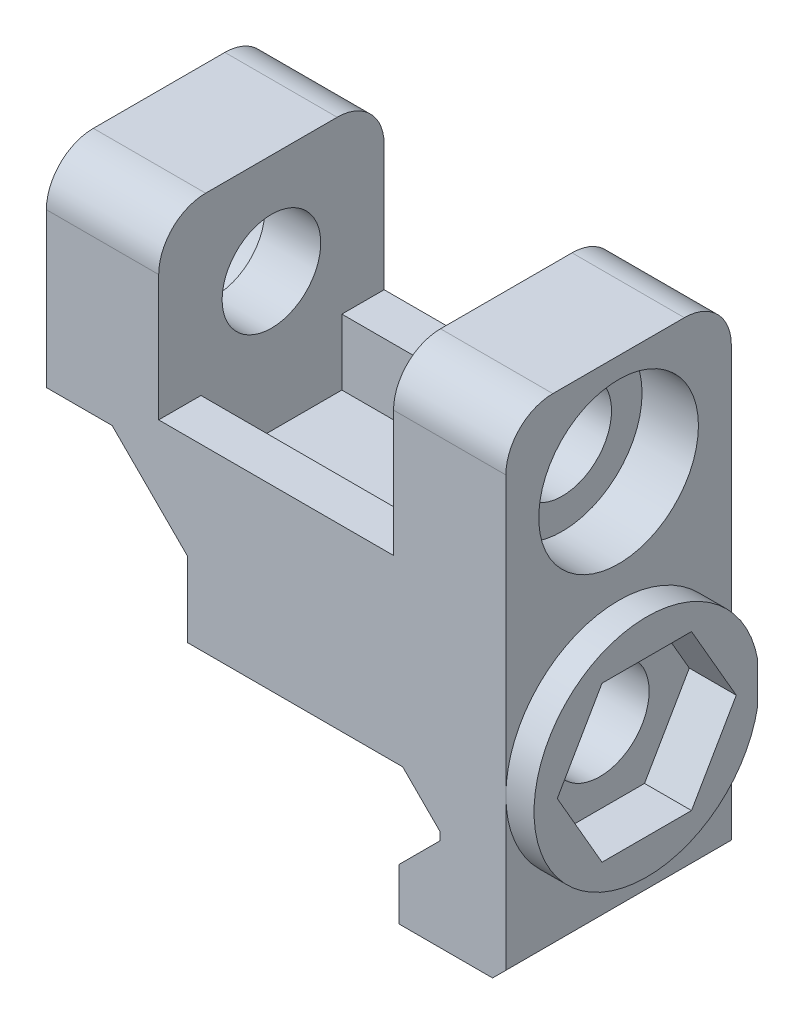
ISO-10303-21;
HEADER;
FILE_DESCRIPTION(('STEP AP214'),'2;1');
FILE_NAME('part.step','',(''),(''),'','','');
FILE_SCHEMA(('AUTOMOTIVE_DESIGN { 1 0 10303 214 1 1 1 1 }'));
ENDSEC;
DATA;
#1=APPLICATION_CONTEXT('core data for automotive mechanical design processes');
#2=APPLICATION_PROTOCOL_DEFINITION('international standard','automotive_design',2000,#1);
#3=PRODUCT_CONTEXT('',#1,'mechanical');
#4=PRODUCT('Part','Part','',(#3));
#5=PRODUCT_RELATED_PRODUCT_CATEGORY('part','',(#4));
#6=PRODUCT_DEFINITION_FORMATION('','',#4);
#7=PRODUCT_DEFINITION_CONTEXT('part definition',#1,'design');
#8=PRODUCT_DEFINITION('design','',#6,#7);
#9=PRODUCT_DEFINITION_SHAPE('','',#8);
#10=(LENGTH_UNIT() NAMED_UNIT(*) SI_UNIT(.MILLI.,.METRE.));
#11=(NAMED_UNIT(*) PLANE_ANGLE_UNIT() SI_UNIT($,.RADIAN.));
#12=(NAMED_UNIT(*) SI_UNIT($,.STERADIAN.) SOLID_ANGLE_UNIT());
#13=UNCERTAINTY_MEASURE_WITH_UNIT(LENGTH_MEASURE(1.E-05),#10,'distance_accuracy_value','');
#14=(GEOMETRIC_REPRESENTATION_CONTEXT(3) GLOBAL_UNCERTAINTY_ASSIGNED_CONTEXT((#13)) GLOBAL_UNIT_ASSIGNED_CONTEXT((#10,
#11,#12)) REPRESENTATION_CONTEXT('',''));
#15=CARTESIAN_POINT('',(0.,0.,0.));
#16=DIRECTION('',(0.,0.,1.));
#17=DIRECTION('',(1.,0.,0.));
#18=AXIS2_PLACEMENT_3D('',#15,#16,#17);
#19=CARTESIAN_POINT('',(16.9545,19.7485,7.62));
#20=DIRECTION('',(-1.,0.,0.));
#21=DIRECTION('',(0.,-1.,0.));
#22=AXIS2_PLACEMENT_3D('',#19,#20,#21);
#23=CYLINDRICAL_SURFACE('',#22,3.33375);
#24=CARTESIAN_POINT('',(7.45807499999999,19.7485,7.62));
#25=DIRECTION('',(1.,0.,0.));
#26=DIRECTION('',(0.,0.,-1.));
#27=AXIS2_PLACEMENT_3D('',#24,#25,#26);
#28=CIRCLE('',#27,3.33375);
#29=CARTESIAN_POINT('',(7.45807499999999,19.7485,4.28625));
#30=VERTEX_POINT('',#29);
#31=EDGE_CURVE('E628',#30,#30,#28,.T.);
#32=ORIENTED_EDGE('',*,*,#31,.F.);
#33=EDGE_LOOP('',(#32));
#34=FACE_BOUND('',#33,.T.);
#35=CARTESIAN_POINT('',(11.2395,19.7485,7.62));
#36=DIRECTION('',(1.,0.,0.));
#37=DIRECTION('',(0.,0.,-1.));
#38=AXIS2_PLACEMENT_3D('',#35,#36,#37);
#39=CIRCLE('',#38,3.33375);
#40=CARTESIAN_POINT('',(11.2395,19.7485,4.28625));
#41=VERTEX_POINT('',#40);
#42=EDGE_CURVE('E65',#41,#41,#39,.F.);
#43=ORIENTED_EDGE('',*,*,#42,.F.);
#44=EDGE_LOOP('',(#43));
#45=FACE_BOUND('',#44,.T.);
#46=ADVANCED_FACE('F61',(#34,#45),#23,.F.);
#47=CARTESIAN_POINT('',(-8.41692500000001,19.7485,7.62));
#48=DIRECTION('',(-1.,0.,0.));
#49=DIRECTION('',(0.,0.,1.));
#50=AXIS2_PLACEMENT_3D('',#47,#48,#49);
#51=CIRCLE('',#50,3.33375);
#52=CARTESIAN_POINT('',(-8.41692500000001,19.7485,10.95375));
#53=VERTEX_POINT('',#52);
#54=EDGE_CURVE('E624',#53,#53,#51,.T.);
#55=ORIENTED_EDGE('',*,*,#54,.F.);
#56=EDGE_LOOP('',(#55));
#57=FACE_BOUND('',#56,.T.);
#58=CARTESIAN_POINT('',(-12.19835,19.7485,7.62));
#59=DIRECTION('',(-1.,0.,0.));
#60=DIRECTION('',(0.,-1.,0.));
#61=AXIS2_PLACEMENT_3D('',#58,#59,#60);
#62=CIRCLE('',#61,3.33375);
#63=CARTESIAN_POINT('',(-12.19835,16.41475,7.62));
#64=VERTEX_POINT('',#63);
#65=EDGE_CURVE('E629',#64,#64,#62,.F.);
#66=ORIENTED_EDGE('',*,*,#65,.F.);
#67=EDGE_LOOP('',(#66));
#68=FACE_BOUND('',#67,.T.);
#69=ADVANCED_FACE('F836',(#57,#68),#23,.F.);
#70=CARTESIAN_POINT('',(-11.56335,14.859,57.0159936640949));
#71=DIRECTION('',(0.,1.,0.));
#72=DIRECTION('',(0.,0.,1.));
#73=AXIS2_PLACEMENT_3D('',#70,#71,#72);
#74=PLANE('',#73);
#75=DIRECTION('',(1.,0.,0.));
#76=VECTOR('',#75,1.);
#77=CARTESIAN_POINT('',(-11.56335,14.859,0.));
#78=LINE('',#77,#76);
#79=CARTESIAN_POINT('',(-8.41692500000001,14.859,0.));
#80=VERTEX_POINT('',#79);
#81=CARTESIAN_POINT('',(7.45807499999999,14.859,0.));
#82=VERTEX_POINT('',#81);
#83=EDGE_CURVE('E357',#80,#82,#78,.T.);
#84=ORIENTED_EDGE('',*,*,#83,.F.);
#85=DIRECTION('',(0.,0.,-1.));
#86=VECTOR('',#85,1.);
#87=CARTESIAN_POINT('',(-8.41692500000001,14.859,26.3332887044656));
#88=LINE('',#87,#86);
#89=CARTESIAN_POINT('',(-8.41692500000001,14.859,2.85750000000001));
#90=VERTEX_POINT('',#89);
#91=EDGE_CURVE('E334',#90,#80,#88,.T.);
#92=ORIENTED_EDGE('',*,*,#91,.F.);
#93=DIRECTION('',(-1.,0.,0.));
#94=VECTOR('',#93,1.);
#95=CARTESIAN_POINT('',(-8.41692500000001,14.859,2.8575));
#96=LINE('',#95,#94);
#97=CARTESIAN_POINT('',(7.45807499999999,14.859,2.8575));
#98=VERTEX_POINT('',#97);
#99=EDGE_CURVE('E714',#98,#90,#96,.T.);
#100=ORIENTED_EDGE('',*,*,#99,.F.);
#101=DIRECTION('',(0.,0.,-1.));
#102=VECTOR('',#101,1.);
#103=CARTESIAN_POINT('',(7.45807499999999,14.859,26.3332887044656));
#104=LINE('',#103,#102);
#105=EDGE_CURVE('E711',#98,#82,#104,.T.);
#106=ORIENTED_EDGE('',*,*,#105,.T.);
#107=EDGE_LOOP('',(#84,#92,#100,#106));
#108=FACE_BOUND('',#107,.T.);
#109=ADVANCED_FACE('F756',(#108),#74,.T.);
#110=DIRECTION('',(1.,0.,0.));
#111=VECTOR('',#110,1.);
#112=CARTESIAN_POINT('',(-8.41692500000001,14.859,12.3825));
#113=LINE('',#112,#111);
#114=CARTESIAN_POINT('',(-8.41692500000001,14.859,12.3825));
#115=VERTEX_POINT('',#114);
#116=CARTESIAN_POINT('',(7.45807499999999,14.859,12.3825));
#117=VERTEX_POINT('',#116);
#118=EDGE_CURVE('E331',#115,#117,#113,.T.);
#119=ORIENTED_EDGE('',*,*,#118,.F.);
#120=CARTESIAN_POINT('',(-8.41692500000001,14.859,15.24));
#121=VERTEX_POINT('',#120);
#122=EDGE_CURVE('E313',#121,#115,#88,.T.);
#123=ORIENTED_EDGE('',*,*,#122,.F.);
#124=DIRECTION('',(1.,0.,0.));
#125=VECTOR('',#124,1.);
#126=CARTESIAN_POINT('',(-11.56335,14.859,15.24));
#127=LINE('',#126,#125);
#128=CARTESIAN_POINT('',(7.45807499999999,14.859,15.24));
#129=VERTEX_POINT('',#128);
#130=EDGE_CURVE('E328',#121,#129,#127,.T.);
#131=ORIENTED_EDGE('',*,*,#130,.T.);
#132=EDGE_CURVE('E715',#129,#117,#104,.T.);
#133=ORIENTED_EDGE('',*,*,#132,.T.);
#134=EDGE_LOOP('',(#119,#123,#131,#133));
#135=FACE_BOUND('',#134,.T.);
#136=ADVANCED_FACE('F327',(#135),#74,.T.);
#137=CARTESIAN_POINT('',(15.0495,-5.62977438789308,15.24));
#138=DIRECTION('',(-1.,0.,0.));
#139=DIRECTION('',(0.,0.,1.));
#140=AXIS2_PLACEMENT_3D('',#137,#138,#139);
#141=PLANE('',#140);
#142=CARTESIAN_POINT('',(15.0495,19.7485,7.62));
#143=DIRECTION('',(1.,0.,0.));
#144=DIRECTION('',(0.,0.,-1.));
#145=AXIS2_PLACEMENT_3D('',#142,#143,#144);
#146=CIRCLE('',#145,5.3975);
#147=CARTESIAN_POINT('',(15.0495,19.7485,2.2225));
#148=VERTEX_POINT('',#147);
#149=EDGE_CURVE('E686',#148,#148,#146,.T.);
#150=ORIENTED_EDGE('',*,*,#149,.F.);
#151=EDGE_LOOP('',(#150));
#152=FACE_BOUND('',#151,.T.);
#153=DIRECTION('',(0.,0.,-1.));
#154=VECTOR('',#153,1.);
#155=CARTESIAN_POINT('',(15.0495,26.543,29.1736136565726));
#156=LINE('',#155,#154);
#157=CARTESIAN_POINT('',(15.0495,26.543,12.065));
#158=VERTEX_POINT('',#157);
#159=CARTESIAN_POINT('',(15.0495,26.543,3.175));
#160=VERTEX_POINT('',#159);
#161=EDGE_CURVE('E693',#158,#160,#156,.T.);
#162=ORIENTED_EDGE('',*,*,#161,.F.);
#163=CARTESIAN_POINT('',(15.0495,23.368,12.065));
#164=DIRECTION('',(-1.,0.,0.));
#165=DIRECTION('',(0.,0.,1.));
#166=AXIS2_PLACEMENT_3D('',#163,#164,#165);
#167=CIRCLE('',#166,3.175);
#168=CARTESIAN_POINT('',(15.0495,23.368,15.24));
#169=VERTEX_POINT('',#168);
#170=EDGE_CURVE('E651',#158,#169,#167,.F.);
#171=ORIENTED_EDGE('',*,*,#170,.T.);
#172=DIRECTION('',(0.,1.,0.));
#173=VECTOR('',#172,1.);
#174=CARTESIAN_POINT('',(15.0495,-5.62977438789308,15.24));
#175=LINE('',#174,#173);
#176=CARTESIAN_POINT('',(15.0495,4.59292261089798,15.24));
#177=VERTEX_POINT('',#176);
#178=EDGE_CURVE('E547',#177,#169,#175,.T.);
#179=ORIENTED_EDGE('',*,*,#178,.F.);
#180=CARTESIAN_POINT('',(15.0495,4.59292261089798,7.62));
#181=DIRECTION('',(-1.,0.,0.));
#182=DIRECTION('',(0.,0.,1.));
#183=AXIS2_PLACEMENT_3D('',#180,#181,#182);
#184=CIRCLE('',#183,7.62);
#185=CARTESIAN_POINT('',(15.0495,5.97832904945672,0.127000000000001));
#186=VERTEX_POINT('',#185);
#187=EDGE_CURVE('E431',#186,#177,#184,.F.);
#188=ORIENTED_EDGE('',*,*,#187,.F.);
#189=DIRECTION('',(0.,1.,0.));
#190=VECTOR('',#189,1.);
#191=CARTESIAN_POINT('',(15.0495,-5.62977438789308,0.127));
#192=LINE('',#191,#190);
#193=CARTESIAN_POINT('',(15.0495,3.20751617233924,0.127000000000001));
#194=VERTEX_POINT('',#193);
#195=EDGE_CURVE('E608',#194,#186,#192,.T.);
#196=ORIENTED_EDGE('',*,*,#195,.F.);
#197=EDGE_CURVE('E435',#177,#194,#184,.F.);
#198=ORIENTED_EDGE('',*,*,#197,.F.);
#199=CARTESIAN_POINT('',(15.0495,-5.62977438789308,15.24));
#200=VERTEX_POINT('',#199);
#201=EDGE_CURVE('E548',#200,#177,#175,.T.);
#202=ORIENTED_EDGE('',*,*,#201,.F.);
#203=DIRECTION('',(0.,0.,-1.));
#204=VECTOR('',#203,1.);
#205=CARTESIAN_POINT('',(15.0495,-5.62977438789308,15.24));
#206=LINE('',#205,#204);
#207=CARTESIAN_POINT('',(15.0495,-5.62977438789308,0.));
#208=VERTEX_POINT('',#207);
#209=EDGE_CURVE('E551',#200,#208,#206,.T.);
#210=ORIENTED_EDGE('',*,*,#209,.T.);
#211=DIRECTION('',(0.,1.,0.));
#212=VECTOR('',#211,1.);
#213=CARTESIAN_POINT('',(15.0495,-5.62977438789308,0.));
#214=LINE('',#213,#212);
#215=CARTESIAN_POINT('',(15.0495,23.368,0.));
#216=VERTEX_POINT('',#215);
#217=EDGE_CURVE('E532',#208,#216,#214,.T.);
#218=ORIENTED_EDGE('',*,*,#217,.T.);
#219=CARTESIAN_POINT('',(15.0495,23.368,3.175));
#220=DIRECTION('',(-1.,0.,0.));
#221=DIRECTION('',(0.,0.,1.));
#222=AXIS2_PLACEMENT_3D('',#219,#220,#221);
#223=CIRCLE('',#222,3.175);
#224=EDGE_CURVE('E648',#216,#160,#223,.F.);
#225=ORIENTED_EDGE('',*,*,#224,.T.);
#226=EDGE_LOOP('',(#162,#171,#179,#188,#196,#198,#202,#210,#218,#225));
#227=FACE_BOUND('',#226,.T.);
#228=ADVANCED_FACE('F768',(#152,#227),#141,.F.);
#229=CARTESIAN_POINT('',(-12.8905,4.59292261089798,7.62));
#230=DIRECTION('',(1.,0.,0.));
#231=DIRECTION('',(0.,0.,-1.));
#232=AXIS2_PLACEMENT_3D('',#229,#230,#231);
#233=CYLINDRICAL_SURFACE('',#232,3.33375);
#234=CARTESIAN_POINT('',(8.07720000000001,4.59292261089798,7.62));
#235=DIRECTION('',(1.,0.,0.));
#236=DIRECTION('',(0.,0.,-1.));
#237=AXIS2_PLACEMENT_3D('',#234,#235,#236);
#238=CIRCLE('',#237,3.33375);
#239=CARTESIAN_POINT('',(8.07720000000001,4.59292261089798,10.95375));
#240=VERTEX_POINT('',#239);
#241=CARTESIAN_POINT('',(8.07720000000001,2.794,10.4267359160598));
#242=VERTEX_POINT('',#241);
#243=EDGE_CURVE('E372',#240,#242,#238,.T.);
#244=ORIENTED_EDGE('',*,*,#243,.F.);
#245=DIRECTION('',(-1.,0.,0.));
#246=VECTOR('',#245,1.);
#247=CARTESIAN_POINT('',(8.07720000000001,4.59292261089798,10.95375));
#248=LINE('',#247,#246);
#249=CARTESIAN_POINT('',(-6.48335000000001,4.59292261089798,10.95375));
#250=VERTEX_POINT('',#249);
#251=EDGE_CURVE('E385',#240,#250,#248,.T.);
#252=ORIENTED_EDGE('',*,*,#251,.T.);
#253=CARTESIAN_POINT('',(-6.48335000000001,4.59292261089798,7.62));
#254=DIRECTION('',(1.,0.,0.));
#255=DIRECTION('',(0.,0.,-1.));
#256=AXIS2_PLACEMENT_3D('',#253,#254,#255);
#257=CIRCLE('',#256,3.33375);
#258=CARTESIAN_POINT('',(-6.48335000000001,7.87400000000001,8.21027131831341));
#259=VERTEX_POINT('',#258);
#260=EDGE_CURVE('E604',#250,#259,#257,.F.);
#261=ORIENTED_EDGE('',*,*,#260,.T.);
#262=CARTESIAN_POINT('',(-3.20227261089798,4.59292261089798,7.62));
#263=DIRECTION('',(-0.707106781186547,-0.707106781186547,0.));
#264=DIRECTION('',(0.707106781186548,-0.707106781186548,0.));
#265=AXIS2_PLACEMENT_3D('',#262,#263,#264);
#266=ELLIPSE('',#265,4.71463446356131,3.33375);
#267=CARTESIAN_POINT('',(-6.48335000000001,7.874,7.02972868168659));
#268=VERTEX_POINT('',#267);
#269=EDGE_CURVE('E493',#259,#268,#266,.T.);
#270=ORIENTED_EDGE('',*,*,#269,.T.);
#271=CARTESIAN_POINT('',(-6.48335000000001,2.794,4.81326408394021));
#272=VERTEX_POINT('',#271);
#273=EDGE_CURVE('E600',#268,#272,#257,.F.);
#274=ORIENTED_EDGE('',*,*,#273,.T.);
#275=DIRECTION('',(1.,0.,0.));
#276=VECTOR('',#275,1.);
#277=CARTESIAN_POINT('',(-12.8905,2.794,4.81326408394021));
#278=LINE('',#277,#276);
#279=CARTESIAN_POINT('',(8.07720000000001,2.794,4.81326408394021));
#280=VERTEX_POINT('',#279);
#281=EDGE_CURVE('E494',#280,#272,#278,.F.);
#282=ORIENTED_EDGE('',*,*,#281,.F.);
#283=CARTESIAN_POINT('',(6.27827738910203,4.59292261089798,7.62));
#284=DIRECTION('',(0.707106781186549,0.707106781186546,0.));
#285=DIRECTION('',(0.707106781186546,-0.707106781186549,0.));
#286=AXIS2_PLACEMENT_3D('',#283,#284,#285);
#287=ELLIPSE('',#286,4.7146344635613,3.33375);
#288=EDGE_CURVE('E497',#242,#280,#287,.T.);
#289=ORIENTED_EDGE('',*,*,#288,.F.);
#290=EDGE_LOOP('',(#244,#252,#261,#270,#274,#282,#289));
#291=FACE_BOUND('',#290,.T.);
#292=CARTESIAN_POINT('',(13.7795,4.59292261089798,7.62));
#293=DIRECTION('',(1.,0.,0.));
#294=DIRECTION('',(0.,0.,-1.));
#295=AXIS2_PLACEMENT_3D('',#292,#293,#294);
#296=CIRCLE('',#295,3.33375);
#297=CARTESIAN_POINT('',(13.7795,4.59292261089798,4.28625));
#298=VERTEX_POINT('',#297);
#299=EDGE_CURVE('E479',#298,#298,#296,.F.);
#300=ORIENTED_EDGE('',*,*,#299,.F.);
#301=EDGE_LOOP('',(#300));
#302=FACE_BOUND('',#301,.T.);
#303=ADVANCED_FACE('F1166',(#291,#302),#233,.F.);
#304=CARTESIAN_POINT('',(-8.0772,2.794,15.24));
#305=DIRECTION('',(0.,1.,0.));
#306=DIRECTION('',(0.,0.,1.));
#307=AXIS2_PLACEMENT_3D('',#304,#305,#306);
#308=PLANE('',#307);
#309=DIRECTION('',(0.,0.,-1.));
#310=VECTOR('',#309,1.);
#311=CARTESIAN_POINT('',(-6.48335000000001,2.794,15.24));
#312=LINE('',#311,#310);
#313=CARTESIAN_POINT('',(-6.48335000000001,2.794,15.24));
#314=VERTEX_POINT('',#313);
#315=CARTESIAN_POINT('',(-6.48335000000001,2.794,10.95375));
#316=VERTEX_POINT('',#315);
#317=EDGE_CURVE('E485',#314,#316,#312,.T.);
#318=ORIENTED_EDGE('',*,*,#317,.T.);
#319=DIRECTION('',(-1.,0.,0.));
#320=VECTOR('',#319,1.);
#321=CARTESIAN_POINT('',(8.07720000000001,2.794,10.95375));
#322=LINE('',#321,#320);
#323=CARTESIAN_POINT('',(8.07720000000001,2.794,10.95375));
#324=VERTEX_POINT('',#323);
#325=EDGE_CURVE('E382',#324,#316,#322,.T.);
#326=ORIENTED_EDGE('',*,*,#325,.F.);
#327=DIRECTION('',(0.,0.,-1.));
#328=VECTOR('',#327,1.);
#329=CARTESIAN_POINT('',(8.07720000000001,2.794,15.24));
#330=LINE('',#329,#328);
#331=CARTESIAN_POINT('',(8.07720000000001,2.794,15.24));
#332=VERTEX_POINT('',#331);
#333=EDGE_CURVE('E596',#332,#324,#330,.T.);
#334=ORIENTED_EDGE('',*,*,#333,.F.);
#335=DIRECTION('',(1.,0.,0.));
#336=VECTOR('',#335,1.);
#337=CARTESIAN_POINT('',(8.07720000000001,2.794,15.24));
#338=LINE('',#337,#336);
#339=EDGE_CURVE('E524',#314,#332,#338,.T.);
#340=ORIENTED_EDGE('',*,*,#339,.F.);
#341=EDGE_LOOP('',(#318,#326,#334,#340));
#342=FACE_BOUND('',#341,.T.);
#343=ADVANCED_FACE('F1159',(#342),#308,.F.);
#344=ORIENTED_EDGE('',*,*,#281,.T.);
#345=CARTESIAN_POINT('',(-6.48335000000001,2.794,0.));
#346=VERTEX_POINT('',#345);
#347=EDGE_CURVE('E484',#272,#346,#312,.T.);
#348=ORIENTED_EDGE('',*,*,#347,.T.);
#349=DIRECTION('',(1.,0.,0.));
#350=VECTOR('',#349,1.);
#351=CARTESIAN_POINT('',(8.07720000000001,2.794,0.));
#352=LINE('',#351,#350);
#353=CARTESIAN_POINT('',(8.07720000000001,2.794,0.));
#354=VERTEX_POINT('',#353);
#355=EDGE_CURVE('E518',#346,#354,#352,.T.);
#356=ORIENTED_EDGE('',*,*,#355,.T.);
#357=EDGE_CURVE('E595',#280,#354,#330,.T.);
#358=ORIENTED_EDGE('',*,*,#357,.F.);
#359=EDGE_LOOP('',(#344,#348,#356,#358));
#360=FACE_BOUND('',#359,.T.);
#361=ADVANCED_FACE('F1151',(#360),#308,.F.);
#362=CARTESIAN_POINT('',(8.07720000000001,2.794,15.24));
#363=DIRECTION('',(0.707106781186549,0.707106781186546,0.));
#364=DIRECTION('',(-0.707106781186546,0.707106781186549,0.));
#365=AXIS2_PLACEMENT_3D('',#362,#363,#364);
#366=PLANE('',#365);
#367=ORIENTED_EDGE('',*,*,#333,.T.);
#368=DIRECTION('',(0.,0.,1.));
#369=VECTOR('',#368,1.);
#370=CARTESIAN_POINT('',(8.07720000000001,2.794,10.95375));
#371=LINE('',#370,#369);
#372=EDGE_CURVE('E375',#242,#324,#371,.T.);
#373=ORIENTED_EDGE('',*,*,#372,.F.);
#374=ORIENTED_EDGE('',*,*,#288,.T.);
#375=ORIENTED_EDGE('',*,*,#357,.T.);
#376=DIRECTION('',(0.707106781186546,-0.707106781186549,0.));
#377=VECTOR('',#376,1.);
#378=CARTESIAN_POINT('',(8.07720000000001,2.794,0.));
#379=LINE('',#378,#377);
#380=CARTESIAN_POINT('',(10.6045,0.266699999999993,0.));
#381=VERTEX_POINT('',#380);
#382=EDGE_CURVE('E527',#354,#381,#379,.T.);
#383=ORIENTED_EDGE('',*,*,#382,.T.);
#384=DIRECTION('',(0.,0.,-1.));
#385=VECTOR('',#384,1.);
#386=CARTESIAN_POINT('',(10.6045,0.266699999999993,15.24));
#387=LINE('',#386,#385);
#388=CARTESIAN_POINT('',(10.6045,0.266699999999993,15.24));
#389=VERTEX_POINT('',#388);
#390=EDGE_CURVE('E591',#389,#381,#387,.T.);
#391=ORIENTED_EDGE('',*,*,#390,.F.);
#392=DIRECTION('',(0.707106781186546,-0.707106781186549,0.));
#393=VECTOR('',#392,1.);
#394=CARTESIAN_POINT('',(8.07720000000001,2.794,15.24));
#395=LINE('',#394,#393);
#396=EDGE_CURVE('E528',#332,#389,#395,.T.);
#397=ORIENTED_EDGE('',*,*,#396,.F.);
#398=EDGE_LOOP('',(#367,#373,#374,#375,#383,#391,#397));
#399=FACE_BOUND('',#398,.T.);
#400=ADVANCED_FACE('F1143',(#399),#366,.F.);
#401=CARTESIAN_POINT('',(10.6045,0.266699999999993,15.24));
#402=DIRECTION('',(1.,0.,0.));
#403=DIRECTION('',(0.,1.,0.));
#404=AXIS2_PLACEMENT_3D('',#401,#402,#403);
#405=PLANE('',#404);
#406=DIRECTION('',(0.,-1.,0.));
#407=VECTOR('',#406,1.);
#408=CARTESIAN_POINT('',(10.6045,0.266699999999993,0.));
#409=LINE('',#408,#407);
#410=CARTESIAN_POINT('',(10.6045,-0.266699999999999,0.));
#411=VERTEX_POINT('',#410);
#412=EDGE_CURVE('E554',#381,#411,#409,.T.);
#413=ORIENTED_EDGE('',*,*,#412,.T.);
#414=DIRECTION('',(0.,0.,-1.));
#415=VECTOR('',#414,1.);
#416=CARTESIAN_POINT('',(10.6045,-0.266699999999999,15.24));
#417=LINE('',#416,#415);
#418=CARTESIAN_POINT('',(10.6045,-0.266699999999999,15.24));
#419=VERTEX_POINT('',#418);
#420=EDGE_CURVE('E587',#419,#411,#417,.T.);
#421=ORIENTED_EDGE('',*,*,#420,.F.);
#422=DIRECTION('',(0.,-1.,0.));
#423=VECTOR('',#422,1.);
#424=CARTESIAN_POINT('',(10.6045,0.266699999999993,15.24));
#425=LINE('',#424,#423);
#426=EDGE_CURVE('E531',#389,#419,#425,.T.);
#427=ORIENTED_EDGE('',*,*,#426,.F.);
#428=ORIENTED_EDGE('',*,*,#390,.T.);
#429=EDGE_LOOP('',(#413,#421,#427,#428));
#430=FACE_BOUND('',#429,.T.);
#431=ADVANCED_FACE('F1135',(#430),#405,.F.);
#432=CARTESIAN_POINT('',(10.6045,-0.266699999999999,15.24));
#433=DIRECTION('',(0.707106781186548,-0.707106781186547,0.));
#434=DIRECTION('',(0.707106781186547,0.707106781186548,0.));
#435=AXIS2_PLACEMENT_3D('',#432,#433,#434);
#436=PLANE('',#435);
#437=DIRECTION('',(-0.707106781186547,-0.707106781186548,0.));
#438=VECTOR('',#437,1.);
#439=CARTESIAN_POINT('',(10.6045,-0.266699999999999,0.));
#440=LINE('',#439,#438);
#441=CARTESIAN_POINT('',(7.8359,-3.03530000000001,0.));
#442=VERTEX_POINT('',#441);
#443=EDGE_CURVE('E557',#411,#442,#440,.T.);
#444=ORIENTED_EDGE('',*,*,#443,.T.);
#445=DIRECTION('',(0.,0.,-1.));
#446=VECTOR('',#445,1.);
#447=CARTESIAN_POINT('',(7.8359,-3.03530000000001,15.24));
#448=LINE('',#447,#446);
#449=CARTESIAN_POINT('',(7.8359,-3.03530000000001,15.24));
#450=VERTEX_POINT('',#449);
#451=EDGE_CURVE('E583',#450,#442,#448,.T.);
#452=ORIENTED_EDGE('',*,*,#451,.F.);
#453=DIRECTION('',(-0.707106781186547,-0.707106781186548,0.));
#454=VECTOR('',#453,1.);
#455=CARTESIAN_POINT('',(10.6045,-0.266699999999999,15.24));
#456=LINE('',#455,#454);
#457=EDGE_CURVE('E535',#419,#450,#456,.T.);
#458=ORIENTED_EDGE('',*,*,#457,.F.);
#459=ORIENTED_EDGE('',*,*,#420,.T.);
#460=EDGE_LOOP('',(#444,#452,#458,#459));
#461=FACE_BOUND('',#460,.T.);
#462=ADVANCED_FACE('F1127',(#461),#436,.F.);
#463=CARTESIAN_POINT('',(7.8359,-3.03530000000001,15.24));
#464=DIRECTION('',(1.,0.,0.));
#465=DIRECTION('',(0.,0.,-1.));
#466=AXIS2_PLACEMENT_3D('',#463,#464,#465);
#467=PLANE('',#466);
#468=DIRECTION('',(0.,-1.,0.));
#469=VECTOR('',#468,1.);
#470=CARTESIAN_POINT('',(7.8359,-3.03530000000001,0.));
#471=LINE('',#470,#469);
#472=CARTESIAN_POINT('',(7.8359,-6.5278,0.));
#473=VERTEX_POINT('',#472);
#474=EDGE_CURVE('E560',#442,#473,#471,.T.);
#475=ORIENTED_EDGE('',*,*,#474,.T.);
#476=DIRECTION('',(0.,0.,-1.));
#477=VECTOR('',#476,1.);
#478=CARTESIAN_POINT('',(7.8359,-6.5278,15.24));
#479=LINE('',#478,#477);
#480=CARTESIAN_POINT('',(7.8359,-6.5278,15.24));
#481=VERTEX_POINT('',#480);
#482=EDGE_CURVE('E579',#481,#473,#479,.T.);
#483=ORIENTED_EDGE('',*,*,#482,.F.);
#484=DIRECTION('',(0.,-1.,0.));
#485=VECTOR('',#484,1.);
#486=CARTESIAN_POINT('',(7.8359,-3.03530000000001,15.24));
#487=LINE('',#486,#485);
#488=EDGE_CURVE('E538',#450,#481,#487,.T.);
#489=ORIENTED_EDGE('',*,*,#488,.F.);
#490=ORIENTED_EDGE('',*,*,#451,.T.);
#491=EDGE_LOOP('',(#475,#483,#489,#490));
#492=FACE_BOUND('',#491,.T.);
#493=ADVANCED_FACE('F1119',(#492),#467,.F.);
#494=CARTESIAN_POINT('',(7.8359,-6.5278,15.24));
#495=DIRECTION('',(0.,1.,0.));
#496=DIRECTION('',(0.,0.,1.));
#497=AXIS2_PLACEMENT_3D('',#494,#495,#496);
#498=PLANE('',#497);
#499=DIRECTION('',(1.,0.,0.));
#500=VECTOR('',#499,1.);
#501=CARTESIAN_POINT('',(7.8359,-6.5278,0.));
#502=LINE('',#501,#500);
#503=CARTESIAN_POINT('',(14.1514743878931,-6.5278,0.));
#504=VERTEX_POINT('',#503);
#505=EDGE_CURVE('E563',#473,#504,#502,.T.);
#506=ORIENTED_EDGE('',*,*,#505,.T.);
#507=DIRECTION('',(0.,0.,-1.));
#508=VECTOR('',#507,1.);
#509=CARTESIAN_POINT('',(14.1514743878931,-6.5278,15.24));
#510=LINE('',#509,#508);
#511=CARTESIAN_POINT('',(14.1514743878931,-6.5278,15.24));
#512=VERTEX_POINT('',#511);
#513=EDGE_CURVE('E575',#512,#504,#510,.T.);
#514=ORIENTED_EDGE('',*,*,#513,.F.);
#515=DIRECTION('',(1.,0.,0.));
#516=VECTOR('',#515,1.);
#517=CARTESIAN_POINT('',(7.8359,-6.5278,15.24));
#518=LINE('',#517,#516);
#519=EDGE_CURVE('E541',#481,#512,#518,.T.);
#520=ORIENTED_EDGE('',*,*,#519,.F.);
#521=ORIENTED_EDGE('',*,*,#482,.T.);
#522=EDGE_LOOP('',(#506,#514,#520,#521));
#523=FACE_BOUND('',#522,.T.);
#524=ADVANCED_FACE('F1110',(#523),#498,.F.);
#525=CARTESIAN_POINT('',(14.1514743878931,-6.5278,15.24));
#526=DIRECTION('',(-0.707106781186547,0.707106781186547,0.));
#527=DIRECTION('',(-0.707106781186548,-0.707106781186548,0.));
#528=AXIS2_PLACEMENT_3D('',#525,#526,#527);
#529=PLANE('',#528);
#530=DIRECTION('',(0.707106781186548,0.707106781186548,0.));
#531=VECTOR('',#530,1.);
#532=CARTESIAN_POINT('',(14.1514743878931,-6.5278,0.));
#533=LINE('',#532,#531);
#534=EDGE_CURVE('E566',#504,#208,#533,.T.);
#535=ORIENTED_EDGE('',*,*,#534,.T.);
#536=ORIENTED_EDGE('',*,*,#209,.F.);
#537=DIRECTION('',(0.707106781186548,0.707106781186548,0.));
#538=VECTOR('',#537,1.);
#539=CARTESIAN_POINT('',(14.1514743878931,-6.5278,15.24));
#540=LINE('',#539,#538);
#541=EDGE_CURVE('E544',#512,#200,#540,.T.);
#542=ORIENTED_EDGE('',*,*,#541,.F.);
#543=ORIENTED_EDGE('',*,*,#513,.T.);
#544=EDGE_LOOP('',(#535,#536,#542,#543));
#545=FACE_BOUND('',#544,.T.);
#546=ADVANCED_FACE('F1100',(#545),#529,.F.);
#547=CARTESIAN_POINT('',(0.,0.,15.24));
#548=DIRECTION('',(0.,0.,1.));
#549=DIRECTION('',(1.,0.,0.));
#550=AXIS2_PLACEMENT_3D('',#547,#548,#549);
#551=PLANE('',#550);
#552=ORIENTED_EDGE('',*,*,#178,.T.);
#553=DIRECTION('',(-1.,0.,0.));
#554=VECTOR('',#553,1.);
#555=CARTESIAN_POINT('',(7.45807499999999,23.368,15.24));
#556=LINE('',#555,#554);
#557=CARTESIAN_POINT('',(7.45807499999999,23.368,15.24));
#558=VERTEX_POINT('',#557);
#559=EDGE_CURVE('E632',#169,#558,#556,.T.);
#560=ORIENTED_EDGE('',*,*,#559,.T.);
#561=DIRECTION('',(0.,-1.,0.));
#562=VECTOR('',#561,1.);
#563=CARTESIAN_POINT('',(7.45807499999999,14.859,15.24));
#564=LINE('',#563,#562);
#565=EDGE_CURVE('E340',#558,#129,#564,.T.);
#566=ORIENTED_EDGE('',*,*,#565,.T.);
#567=ORIENTED_EDGE('',*,*,#130,.F.);
#568=DIRECTION('',(0.,1.,0.));
#569=VECTOR('',#568,1.);
#570=CARTESIAN_POINT('',(-8.41692500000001,14.859,15.24));
#571=LINE('',#570,#569);
#572=CARTESIAN_POINT('',(-8.41692500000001,23.368,15.24));
#573=VERTEX_POINT('',#572);
#574=EDGE_CURVE('E309',#121,#573,#571,.T.);
#575=ORIENTED_EDGE('',*,*,#574,.T.);
#576=DIRECTION('',(-1.,0.,0.));
#577=VECTOR('',#576,1.);
#578=CARTESIAN_POINT('',(-16.00835,23.368,15.24));
#579=LINE('',#578,#577);
#580=CARTESIAN_POINT('',(-16.00835,23.368,15.24));
#581=VERTEX_POINT('',#580);
#582=EDGE_CURVE('E623',#573,#581,#579,.T.);
#583=ORIENTED_EDGE('',*,*,#582,.T.);
#584=DIRECTION('',(0.,-1.,0.));
#585=VECTOR('',#584,1.);
#586=CARTESIAN_POINT('',(-16.00835,12.954,15.24));
#587=LINE('',#586,#585);
#588=CARTESIAN_POINT('',(-16.00835,12.954,15.24));
#589=VERTEX_POINT('',#588);
#590=EDGE_CURVE('E348',#581,#589,#587,.T.);
#591=ORIENTED_EDGE('',*,*,#590,.T.);
#592=DIRECTION('',(1.,0.,0.));
#593=VECTOR('',#592,1.);
#594=CARTESIAN_POINT('',(-11.56335,12.954,15.24));
#595=LINE('',#594,#593);
#596=CARTESIAN_POINT('',(-11.56335,12.954,15.24));
#597=VERTEX_POINT('',#596);
#598=EDGE_CURVE('E342',#589,#597,#595,.T.);
#599=ORIENTED_EDGE('',*,*,#598,.T.);
#600=DIRECTION('',(-0.707106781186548,0.707106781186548,0.));
#601=VECTOR('',#600,1.);
#602=CARTESIAN_POINT('',(-11.56335,12.954,15.24));
#603=LINE('',#602,#601);
#604=CARTESIAN_POINT('',(-6.48335000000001,7.87400000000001,15.24));
#605=VERTEX_POINT('',#604);
#606=EDGE_CURVE('E509',#605,#597,#603,.T.);
#607=ORIENTED_EDGE('',*,*,#606,.F.);
#608=DIRECTION('',(0.,-1.,0.));
#609=VECTOR('',#608,1.);
#610=CARTESIAN_POINT('',(-6.48335000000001,7.87400000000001,15.24));
#611=LINE('',#610,#609);
#612=EDGE_CURVE('E480',#605,#314,#611,.T.);
#613=ORIENTED_EDGE('',*,*,#612,.T.);
#614=ORIENTED_EDGE('',*,*,#339,.T.);
#615=ORIENTED_EDGE('',*,*,#396,.T.);
#616=ORIENTED_EDGE('',*,*,#426,.T.);
#617=ORIENTED_EDGE('',*,*,#457,.T.);
#618=ORIENTED_EDGE('',*,*,#488,.T.);
#619=ORIENTED_EDGE('',*,*,#519,.T.);
#620=ORIENTED_EDGE('',*,*,#541,.T.);
#621=ORIENTED_EDGE('',*,*,#201,.T.);
#622=EDGE_LOOP('',(#552,#560,#566,#567,#575,#583,#591,#599,#607,#613,#614,#615,#616,#617,#618,
#619,#620,#621));
#623=FACE_BOUND('',#622,.T.);
#624=ADVANCED_FACE('F337',(#623),#551,.T.);
#625=CARTESIAN_POINT('',(0.,0.,0.));
#626=DIRECTION('',(0.,0.,1.));
#627=DIRECTION('',(1.,0.,0.));
#628=AXIS2_PLACEMENT_3D('',#625,#626,#627);
#629=PLANE('',#628);
#630=DIRECTION('',(0.,-1.,0.));
#631=VECTOR('',#630,1.);
#632=CARTESIAN_POINT('',(7.45807499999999,14.859,0.));
#633=LINE('',#632,#631);
#634=CARTESIAN_POINT('',(7.45807499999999,23.368,0.));
#635=VERTEX_POINT('',#634);
#636=EDGE_CURVE('E322',#635,#82,#633,.T.);
#637=ORIENTED_EDGE('',*,*,#636,.F.);
#638=DIRECTION('',(-1.,0.,0.));
#639=VECTOR('',#638,1.);
#640=CARTESIAN_POINT('',(0.,23.368,0.));
#641=LINE('',#640,#639);
#642=EDGE_CURVE('E657',#635,#216,#641,.F.);
#643=ORIENTED_EDGE('',*,*,#642,.T.);
#644=ORIENTED_EDGE('',*,*,#217,.F.);
#645=ORIENTED_EDGE('',*,*,#534,.F.);
#646=ORIENTED_EDGE('',*,*,#505,.F.);
#647=ORIENTED_EDGE('',*,*,#474,.F.);
#648=ORIENTED_EDGE('',*,*,#443,.F.);
#649=ORIENTED_EDGE('',*,*,#412,.F.);
#650=ORIENTED_EDGE('',*,*,#382,.F.);
#651=ORIENTED_EDGE('',*,*,#355,.F.);
#652=DIRECTION('',(0.,1.,0.));
#653=VECTOR('',#652,1.);
#654=CARTESIAN_POINT('',(-6.48335000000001,0.,0.));
#655=LINE('',#654,#653);
#656=CARTESIAN_POINT('',(-6.48335000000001,7.87400000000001,0.));
#657=VERTEX_POINT('',#656);
#658=EDGE_CURVE('E489',#346,#657,#655,.T.);
#659=ORIENTED_EDGE('',*,*,#658,.T.);
#660=DIRECTION('',(-0.707106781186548,0.707106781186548,0.));
#661=VECTOR('',#660,1.);
#662=CARTESIAN_POINT('',(-11.56335,12.954,0.));
#663=LINE('',#662,#661);
#664=CARTESIAN_POINT('',(-11.56335,12.954,0.));
#665=VERTEX_POINT('',#664);
#666=EDGE_CURVE('E504',#657,#665,#663,.T.);
#667=ORIENTED_EDGE('',*,*,#666,.T.);
#668=DIRECTION('',(1.,0.,0.));
#669=VECTOR('',#668,1.);
#670=CARTESIAN_POINT('',(-11.56335,12.954,0.));
#671=LINE('',#670,#669);
#672=CARTESIAN_POINT('',(-16.00835,12.954,0.));
#673=VERTEX_POINT('',#672);
#674=EDGE_CURVE('E364',#673,#665,#671,.T.);
#675=ORIENTED_EDGE('',*,*,#674,.F.);
#676=DIRECTION('',(0.,-1.,0.));
#677=VECTOR('',#676,1.);
#678=CARTESIAN_POINT('',(-16.00835,12.954,0.));
#679=LINE('',#678,#677);
#680=CARTESIAN_POINT('',(-16.00835,23.368,0.));
#681=VERTEX_POINT('',#680);
#682=EDGE_CURVE('E361',#681,#673,#679,.T.);
#683=ORIENTED_EDGE('',*,*,#682,.F.);
#684=DIRECTION('',(-1.,0.,0.));
#685=VECTOR('',#684,1.);
#686=CARTESIAN_POINT('',(0.,23.368,0.));
#687=LINE('',#686,#685);
#688=CARTESIAN_POINT('',(-8.41692500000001,23.368,0.));
#689=VERTEX_POINT('',#688);
#690=EDGE_CURVE('E654',#681,#689,#687,.F.);
#691=ORIENTED_EDGE('',*,*,#690,.T.);
#692=DIRECTION('',(0.,1.,0.));
#693=VECTOR('',#692,1.);
#694=CARTESIAN_POINT('',(-8.41692500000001,14.859,0.));
#695=LINE('',#694,#693);
#696=EDGE_CURVE('E323',#80,#689,#695,.T.);
#697=ORIENTED_EDGE('',*,*,#696,.F.);
#698=ORIENTED_EDGE('',*,*,#83,.T.);
#699=EDGE_LOOP('',(#637,#643,#644,#645,#646,#647,#648,#649,#650,#651,#659,#667,#675,#683,#691,
#697,#698));
#700=FACE_BOUND('',#699,.T.);
#701=ADVANCED_FACE('F753',(#700),#629,.F.);
#702=CARTESIAN_POINT('',(-11.56335,12.954,29.381267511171));
#703=DIRECTION('',(-0.707106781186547,-0.707106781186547,0.));
#704=DIRECTION('',(0.707106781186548,-0.707106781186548,0.));
#705=AXIS2_PLACEMENT_3D('',#702,#703,#704);
#706=PLANE('',#705);
#707=ORIENTED_EDGE('',*,*,#269,.F.);
#708=DIRECTION('',(0.,0.,-1.));
#709=VECTOR('',#708,1.);
#710=CARTESIAN_POINT('',(-6.48335000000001,7.87400000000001,29.381267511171));
#711=LINE('',#710,#709);
#712=EDGE_CURVE('E514',#605,#259,#711,.T.);
#713=ORIENTED_EDGE('',*,*,#712,.F.);
#714=ORIENTED_EDGE('',*,*,#606,.T.);
#715=DIRECTION('',(0.,0.,-1.));
#716=VECTOR('',#715,1.);
#717=CARTESIAN_POINT('',(-11.56335,12.954,29.381267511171));
#718=LINE('',#717,#716);
#719=EDGE_CURVE('E513',#597,#665,#718,.T.);
#720=ORIENTED_EDGE('',*,*,#719,.T.);
#721=ORIENTED_EDGE('',*,*,#666,.F.);
#722=EDGE_CURVE('E508',#268,#657,#711,.T.);
#723=ORIENTED_EDGE('',*,*,#722,.F.);
#724=EDGE_LOOP('',(#707,#713,#714,#720,#721,#723));
#725=FACE_BOUND('',#724,.T.);
#726=ADVANCED_FACE('F1090',(#725),#706,.T.);
#727=CARTESIAN_POINT('',(-6.48335000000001,7.87400000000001,15.24));
#728=DIRECTION('',(1.,0.,0.));
#729=DIRECTION('',(0.,0.,-1.));
#730=AXIS2_PLACEMENT_3D('',#727,#728,#729);
#731=PLANE('',#730);
#732=ORIENTED_EDGE('',*,*,#347,.F.);
#733=ORIENTED_EDGE('',*,*,#273,.F.);
#734=ORIENTED_EDGE('',*,*,#722,.T.);
#735=ORIENTED_EDGE('',*,*,#658,.F.);
#736=EDGE_LOOP('',(#732,#733,#734,#735));
#737=FACE_BOUND('',#736,.T.);
#738=ADVANCED_FACE('F832',(#737),#731,.F.);
#739=ORIENTED_EDGE('',*,*,#260,.F.);
#740=DIRECTION('',(0.,1.,0.));
#741=VECTOR('',#740,1.);
#742=CARTESIAN_POINT('',(-6.48335000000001,4.59292261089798,10.95375));
#743=LINE('',#742,#741);
#744=EDGE_CURVE('E371',#316,#250,#743,.T.);
#745=ORIENTED_EDGE('',*,*,#744,.F.);
#746=ORIENTED_EDGE('',*,*,#317,.F.);
#747=ORIENTED_EDGE('',*,*,#612,.F.);
#748=ORIENTED_EDGE('',*,*,#712,.T.);
#749=EDGE_LOOP('',(#739,#745,#746,#747,#748));
#750=FACE_BOUND('',#749,.T.);
#751=ADVANCED_FACE('F824',(#750),#731,.F.);
#752=CARTESIAN_POINT('',(13.7795,4.59292261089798,7.62));
#753=DIRECTION('',(1.,0.,0.));
#754=DIRECTION('',(0.,0.,-1.));
#755=AXIS2_PLACEMENT_3D('',#752,#753,#754);
#756=PLANE('',#755);
#757=ORIENTED_EDGE('',*,*,#299,.T.);
#758=EDGE_LOOP('',(#757));
#759=FACE_BOUND('',#758,.T.);
#760=DIRECTION('',(0.,-0.866025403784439,0.5));
#761=VECTOR('',#760,1.);
#762=CARTESIAN_POINT('',(13.7795,9.83167261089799,10.6445937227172));
#763=LINE('',#762,#761);
#764=CARTESIAN_POINT('',(13.7795,9.83167261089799,10.6445937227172));
#765=VERTEX_POINT('',#764);
#766=CARTESIAN_POINT('',(13.7795,4.59292261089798,13.6691874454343));
#767=VERTEX_POINT('',#766);
#768=EDGE_CURVE('E436',#765,#767,#763,.T.);
#769=ORIENTED_EDGE('',*,*,#768,.T.);
#770=DIRECTION('',(0.,-0.866025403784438,-0.5));
#771=VECTOR('',#770,1.);
#772=CARTESIAN_POINT('',(13.7795,4.59292261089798,13.6691874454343));
#773=LINE('',#772,#771);
#774=CARTESIAN_POINT('',(13.7795,-0.645827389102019,10.6445937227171));
#775=VERTEX_POINT('',#774);
#776=EDGE_CURVE('E440',#767,#775,#773,.T.);
#777=ORIENTED_EDGE('',*,*,#776,.T.);
#778=DIRECTION('',(0.,0.,-1.));
#779=VECTOR('',#778,1.);
#780=CARTESIAN_POINT('',(13.7795,-0.645827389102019,10.6445937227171));
#781=LINE('',#780,#779);
#782=CARTESIAN_POINT('',(13.7795,-0.645827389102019,4.59540627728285));
#783=VERTEX_POINT('',#782);
#784=EDGE_CURVE('E443',#775,#783,#781,.T.);
#785=ORIENTED_EDGE('',*,*,#784,.T.);
#786=DIRECTION('',(0.,0.866025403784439,-0.5));
#787=VECTOR('',#786,1.);
#788=CARTESIAN_POINT('',(13.7795,-0.645827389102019,4.59540627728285));
#789=LINE('',#788,#787);
#790=CARTESIAN_POINT('',(13.7795,4.59292261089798,1.57081255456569));
#791=VERTEX_POINT('',#790);
#792=EDGE_CURVE('E446',#783,#791,#789,.T.);
#793=ORIENTED_EDGE('',*,*,#792,.T.);
#794=DIRECTION('',(0.,0.866025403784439,0.5));
#795=VECTOR('',#794,1.);
#796=CARTESIAN_POINT('',(13.7795,4.59292261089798,1.57081255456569));
#797=LINE('',#796,#795);
#798=CARTESIAN_POINT('',(13.7795,9.83167261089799,4.59540627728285));
#799=VERTEX_POINT('',#798);
#800=EDGE_CURVE('E449',#791,#799,#797,.T.);
#801=ORIENTED_EDGE('',*,*,#800,.T.);
#802=DIRECTION('',(0.,0.,1.));
#803=VECTOR('',#802,1.);
#804=CARTESIAN_POINT('',(13.7795,9.83167261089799,4.59540627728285));
#805=LINE('',#804,#803);
#806=EDGE_CURVE('E452',#799,#765,#805,.T.);
#807=ORIENTED_EDGE('',*,*,#806,.T.);
#808=EDGE_LOOP('',(#769,#777,#785,#793,#801,#807));
#809=FACE_BOUND('',#808,.T.);
#810=ADVANCED_FACE('F822',(#759,#809),#756,.T.);
#811=CARTESIAN_POINT('',(15.0495,9.83167261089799,10.6445937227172));
#812=DIRECTION('',(0.,-0.5,-0.866025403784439));
#813=DIRECTION('',(0.,0.866025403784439,-0.5));
#814=AXIS2_PLACEMENT_3D('',#811,#812,#813);
#815=PLANE('',#814);
#816=ORIENTED_EDGE('',*,*,#768,.F.);
#817=DIRECTION('',(-1.,0.,0.));
#818=VECTOR('',#817,1.);
#819=CARTESIAN_POINT('',(15.0495,9.83167261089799,10.6445937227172));
#820=LINE('',#819,#818);
#821=CARTESIAN_POINT('',(16.9545,9.83167261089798,10.6445937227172));
#822=VERTEX_POINT('',#821);
#823=EDGE_CURVE('E455',#822,#765,#820,.T.);
#824=ORIENTED_EDGE('',*,*,#823,.F.);
#825=DIRECTION('',(0.,-0.866025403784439,0.5));
#826=VECTOR('',#825,1.);
#827=CARTESIAN_POINT('',(16.9545,9.83167261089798,10.6445937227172));
#828=LINE('',#827,#826);
#829=CARTESIAN_POINT('',(16.9545,4.59292261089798,13.6691874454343));
#830=VERTEX_POINT('',#829);
#831=EDGE_CURVE('E389',#822,#830,#828,.T.);
#832=ORIENTED_EDGE('',*,*,#831,.T.);
#833=DIRECTION('',(-1.,0.,0.));
#834=VECTOR('',#833,1.);
#835=CARTESIAN_POINT('',(15.0495,4.59292261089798,13.6691874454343));
#836=LINE('',#835,#834);
#837=EDGE_CURVE('E475',#830,#767,#836,.T.);
#838=ORIENTED_EDGE('',*,*,#837,.T.);
#839=EDGE_LOOP('',(#816,#824,#832,#838));
#840=FACE_BOUND('',#839,.T.);
#841=ADVANCED_FACE('F808',(#840),#815,.T.);
#842=CARTESIAN_POINT('',(15.0495,4.59292261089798,13.6691874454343));
#843=DIRECTION('',(0.,0.5,-0.866025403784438));
#844=DIRECTION('',(0.,0.866025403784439,0.5));
#845=AXIS2_PLACEMENT_3D('',#842,#843,#844);
#846=PLANE('',#845);
#847=ORIENTED_EDGE('',*,*,#776,.F.);
#848=ORIENTED_EDGE('',*,*,#837,.F.);
#849=DIRECTION('',(0.,-0.866025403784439,-0.5));
#850=VECTOR('',#849,1.);
#851=CARTESIAN_POINT('',(16.9545,4.59292261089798,13.6691874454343));
#852=LINE('',#851,#850);
#853=CARTESIAN_POINT('',(16.9545,-0.64582738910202,10.6445937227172));
#854=VERTEX_POINT('',#853);
#855=EDGE_CURVE('E395',#830,#854,#852,.T.);
#856=ORIENTED_EDGE('',*,*,#855,.T.);
#857=DIRECTION('',(-1.,0.,0.));
#858=VECTOR('',#857,1.);
#859=CARTESIAN_POINT('',(15.0495,-0.645827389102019,10.6445937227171));
#860=LINE('',#859,#858);
#861=EDGE_CURVE('E471',#854,#775,#860,.T.);
#862=ORIENTED_EDGE('',*,*,#861,.T.);
#863=EDGE_LOOP('',(#847,#848,#856,#862));
#864=FACE_BOUND('',#863,.T.);
#865=ADVANCED_FACE('F804',(#864),#846,.T.);
#866=CARTESIAN_POINT('',(15.0495,-0.645827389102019,10.6445937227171));
#867=DIRECTION('',(0.,1.,0.));
#868=DIRECTION('',(0.,0.,1.));
#869=AXIS2_PLACEMENT_3D('',#866,#867,#868);
#870=PLANE('',#869);
#871=ORIENTED_EDGE('',*,*,#784,.F.);
#872=ORIENTED_EDGE('',*,*,#861,.F.);
#873=DIRECTION('',(0.,0.,-1.));
#874=VECTOR('',#873,1.);
#875=CARTESIAN_POINT('',(16.9545,-0.64582738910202,10.6445937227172));
#876=LINE('',#875,#874);
#877=CARTESIAN_POINT('',(16.9545,-0.645827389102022,4.59540627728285));
#878=VERTEX_POINT('',#877);
#879=EDGE_CURVE('E399',#854,#878,#876,.T.);
#880=ORIENTED_EDGE('',*,*,#879,.T.);
#881=DIRECTION('',(-1.,0.,0.));
#882=VECTOR('',#881,1.);
#883=CARTESIAN_POINT('',(15.0495,-0.645827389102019,4.59540627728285));
#884=LINE('',#883,#882);
#885=EDGE_CURVE('E467',#878,#783,#884,.T.);
#886=ORIENTED_EDGE('',*,*,#885,.T.);
#887=EDGE_LOOP('',(#871,#872,#880,#886));
#888=FACE_BOUND('',#887,.T.);
#889=ADVANCED_FACE('F820',(#888),#870,.T.);
#890=CARTESIAN_POINT('',(15.0495,-0.645827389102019,4.59540627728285));
#891=DIRECTION('',(0.,0.5,0.866025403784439));
#892=DIRECTION('',(0.,-0.866025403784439,0.5));
#893=AXIS2_PLACEMENT_3D('',#890,#891,#892);
#894=PLANE('',#893);
#895=ORIENTED_EDGE('',*,*,#792,.F.);
#896=ORIENTED_EDGE('',*,*,#885,.F.);
#897=DIRECTION('',(0.,0.866025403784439,-0.5));
#898=VECTOR('',#897,1.);
#899=CARTESIAN_POINT('',(16.9545,-0.645827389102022,4.59540627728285));
#900=LINE('',#899,#898);
#901=CARTESIAN_POINT('',(16.9545,4.59292261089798,1.57081255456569));
#902=VERTEX_POINT('',#901);
#903=EDGE_CURVE('E403',#878,#902,#900,.T.);
#904=ORIENTED_EDGE('',*,*,#903,.T.);
#905=DIRECTION('',(-1.,0.,0.));
#906=VECTOR('',#905,1.);
#907=CARTESIAN_POINT('',(15.0495,4.59292261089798,1.57081255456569));
#908=LINE('',#907,#906);
#909=EDGE_CURVE('E463',#902,#791,#908,.T.);
#910=ORIENTED_EDGE('',*,*,#909,.T.);
#911=EDGE_LOOP('',(#895,#896,#904,#910));
#912=FACE_BOUND('',#911,.T.);
#913=ADVANCED_FACE('F818',(#912),#894,.T.);
#914=CARTESIAN_POINT('',(15.0495,4.59292261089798,1.57081255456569));
#915=DIRECTION('',(0.,-0.5,0.866025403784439));
#916=DIRECTION('',(0.,-0.866025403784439,-0.5));
#917=AXIS2_PLACEMENT_3D('',#914,#915,#916);
#918=PLANE('',#917);
#919=ORIENTED_EDGE('',*,*,#800,.F.);
#920=ORIENTED_EDGE('',*,*,#909,.F.);
#921=DIRECTION('',(0.,0.866025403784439,0.5));
#922=VECTOR('',#921,1.);
#923=CARTESIAN_POINT('',(16.9545,4.59292261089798,1.57081255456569));
#924=LINE('',#923,#922);
#925=CARTESIAN_POINT('',(16.9545,9.83167261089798,4.59540627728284));
#926=VERTEX_POINT('',#925);
#927=EDGE_CURVE('E407',#902,#926,#924,.T.);
#928=ORIENTED_EDGE('',*,*,#927,.T.);
#929=DIRECTION('',(-1.,0.,0.));
#930=VECTOR('',#929,1.);
#931=CARTESIAN_POINT('',(15.0495,9.83167261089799,4.59540627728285));
#932=LINE('',#931,#930);
#933=EDGE_CURVE('E459',#926,#799,#932,.T.);
#934=ORIENTED_EDGE('',*,*,#933,.T.);
#935=EDGE_LOOP('',(#919,#920,#928,#934));
#936=FACE_BOUND('',#935,.T.);
#937=ADVANCED_FACE('F815',(#936),#918,.T.);
#938=CARTESIAN_POINT('',(15.0495,9.83167261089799,4.59540627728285));
#939=DIRECTION('',(0.,-1.,0.));
#940=DIRECTION('',(0.,0.,-1.));
#941=AXIS2_PLACEMENT_3D('',#938,#939,#940);
#942=PLANE('',#941);
#943=ORIENTED_EDGE('',*,*,#806,.F.);
#944=ORIENTED_EDGE('',*,*,#933,.F.);
#945=DIRECTION('',(0.,0.,1.));
#946=VECTOR('',#945,1.);
#947=CARTESIAN_POINT('',(16.9545,9.83167261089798,4.59540627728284));
#948=LINE('',#947,#946);
#949=EDGE_CURVE('E411',#926,#822,#948,.T.);
#950=ORIENTED_EDGE('',*,*,#949,.T.);
#951=ORIENTED_EDGE('',*,*,#823,.T.);
#952=EDGE_LOOP('',(#943,#944,#950,#951));
#953=FACE_BOUND('',#952,.T.);
#954=ADVANCED_FACE('F811',(#953),#942,.T.);
#955=CARTESIAN_POINT('',(16.9545,3.20751617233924,0.127));
#956=DIRECTION('',(0.,0.,1.));
#957=DIRECTION('',(1.,0.,0.));
#958=AXIS2_PLACEMENT_3D('',#955,#956,#957);
#959=PLANE('',#958);
#960=DIRECTION('',(-1.,0.,0.));
#961=VECTOR('',#960,1.);
#962=CARTESIAN_POINT('',(16.9545,3.20751617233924,0.127));
#963=LINE('',#962,#961);
#964=CARTESIAN_POINT('',(16.9545,3.20751617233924,0.127));
#965=VERTEX_POINT('',#964);
#966=EDGE_CURVE('E427',#965,#194,#963,.T.);
#967=ORIENTED_EDGE('',*,*,#966,.T.);
#968=ORIENTED_EDGE('',*,*,#195,.T.);
#969=DIRECTION('',(-1.,0.,0.));
#970=VECTOR('',#969,1.);
#971=CARTESIAN_POINT('',(16.9545,5.97832904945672,0.127));
#972=LINE('',#971,#970);
#973=CARTESIAN_POINT('',(16.9545,5.97832904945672,0.127));
#974=VERTEX_POINT('',#973);
#975=EDGE_CURVE('E423',#974,#186,#972,.T.);
#976=ORIENTED_EDGE('',*,*,#975,.F.);
#977=DIRECTION('',(0.,1.,0.));
#978=VECTOR('',#977,1.);
#979=CARTESIAN_POINT('',(16.9545,3.20751617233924,0.127));
#980=LINE('',#979,#978);
#981=EDGE_CURVE('E419',#965,#974,#980,.T.);
#982=ORIENTED_EDGE('',*,*,#981,.F.);
#983=EDGE_LOOP('',(#967,#968,#976,#982));
#984=FACE_BOUND('',#983,.T.);
#985=ADVANCED_FACE('F790',(#984),#959,.F.);
#986=CARTESIAN_POINT('',(16.9545,4.59292261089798,7.62));
#987=DIRECTION('',(-1.,0.,0.));
#988=DIRECTION('',(0.,0.,1.));
#989=AXIS2_PLACEMENT_3D('',#986,#987,#988);
#990=CYLINDRICAL_SURFACE('',#989,7.62);
#991=ORIENTED_EDGE('',*,*,#187,.T.);
#992=ORIENTED_EDGE('',*,*,#197,.T.);
#993=ORIENTED_EDGE('',*,*,#966,.F.);
#994=CARTESIAN_POINT('',(16.9545,4.59292261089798,7.62));
#995=DIRECTION('',(1.,0.,0.));
#996=DIRECTION('',(0.,0.,-1.));
#997=AXIS2_PLACEMENT_3D('',#994,#995,#996);
#998=CIRCLE('',#997,7.62);
#999=EDGE_CURVE('E415',#974,#965,#998,.T.);
#1000=ORIENTED_EDGE('',*,*,#999,.F.);
#1001=ORIENTED_EDGE('',*,*,#975,.T.);
#1002=EDGE_LOOP('',(#991,#992,#993,#1000,#1001));
#1003=FACE_BOUND('',#1002,.T.);
#1004=ADVANCED_FACE('F788',(#1003),#990,.T.);
#1005=CARTESIAN_POINT('',(16.9545,4.59292261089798,7.62));
#1006=DIRECTION('',(1.,0.,0.));
#1007=DIRECTION('',(0.,0.,-1.));
#1008=AXIS2_PLACEMENT_3D('',#1005,#1006,#1007);
#1009=PLANE('',#1008);
#1010=ORIENTED_EDGE('',*,*,#999,.T.);
#1011=ORIENTED_EDGE('',*,*,#981,.T.);
#1012=EDGE_LOOP('',(#1010,#1011));
#1013=FACE_BOUND('',#1012,.T.);
#1014=ORIENTED_EDGE('',*,*,#855,.F.);
#1015=ORIENTED_EDGE('',*,*,#831,.F.);
#1016=ORIENTED_EDGE('',*,*,#949,.F.);
#1017=ORIENTED_EDGE('',*,*,#927,.F.);
#1018=ORIENTED_EDGE('',*,*,#903,.F.);
#1019=ORIENTED_EDGE('',*,*,#879,.F.);
#1020=EDGE_LOOP('',(#1014,#1015,#1016,#1017,#1018,#1019));
#1021=FACE_BOUND('',#1020,.T.);
#1022=ADVANCED_FACE('F793',(#1013,#1021),#1009,.T.);
#1023=CARTESIAN_POINT('',(8.07720000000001,4.59292261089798,10.95375));
#1024=DIRECTION('',(0.,0.,1.));
#1025=DIRECTION('',(1.,0.,0.));
#1026=AXIS2_PLACEMENT_3D('',#1023,#1024,#1025);
#1027=PLANE('',#1026);
#1028=ORIENTED_EDGE('',*,*,#744,.T.);
#1029=ORIENTED_EDGE('',*,*,#251,.F.);
#1030=DIRECTION('',(0.,1.,0.));
#1031=VECTOR('',#1030,1.);
#1032=CARTESIAN_POINT('',(8.07720000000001,4.59292261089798,10.95375));
#1033=LINE('',#1032,#1031);
#1034=EDGE_CURVE('E378',#324,#240,#1033,.T.);
#1035=ORIENTED_EDGE('',*,*,#1034,.F.);
#1036=ORIENTED_EDGE('',*,*,#325,.T.);
#1037=EDGE_LOOP('',(#1028,#1029,#1035,#1036));
#1038=FACE_BOUND('',#1037,.T.);
#1039=ADVANCED_FACE('F796',(#1038),#1027,.F.);
#1040=CARTESIAN_POINT('',(8.07720000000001,4.59292261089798,7.62));
#1041=DIRECTION('',(1.,0.,0.));
#1042=DIRECTION('',(0.,0.,-1.));
#1043=AXIS2_PLACEMENT_3D('',#1040,#1041,#1042);
#1044=PLANE('',#1043);
#1045=ORIENTED_EDGE('',*,*,#243,.T.);
#1046=ORIENTED_EDGE('',*,*,#372,.T.);
#1047=ORIENTED_EDGE('',*,*,#1034,.T.);
#1048=EDGE_LOOP('',(#1045,#1046,#1047));
#1049=FACE_BOUND('',#1048,.T.);
#1050=ADVANCED_FACE('F871',(#1049),#1044,.F.);
#1051=CARTESIAN_POINT('',(-11.56335,12.954,57.0159936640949));
#1052=DIRECTION('',(0.,1.,0.));
#1053=DIRECTION('',(0.,0.,1.));
#1054=AXIS2_PLACEMENT_3D('',#1051,#1052,#1053);
#1055=PLANE('',#1054);
#1056=ORIENTED_EDGE('',*,*,#719,.F.);
#1057=ORIENTED_EDGE('',*,*,#598,.F.);
#1058=DIRECTION('',(0.,0.,-1.));
#1059=VECTOR('',#1058,1.);
#1060=CARTESIAN_POINT('',(-16.00835,12.954,57.0159936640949));
#1061=LINE('',#1060,#1059);
#1062=EDGE_CURVE('E367',#589,#673,#1061,.T.);
#1063=ORIENTED_EDGE('',*,*,#1062,.T.);
#1064=ORIENTED_EDGE('',*,*,#674,.T.);
#1065=EDGE_LOOP('',(#1056,#1057,#1063,#1064));
#1066=FACE_BOUND('',#1065,.T.);
#1067=ADVANCED_FACE('F868',(#1066),#1055,.F.);
#1068=CARTESIAN_POINT('',(-16.00835,12.954,57.0159936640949));
#1069=DIRECTION('',(1.,0.,0.));
#1070=DIRECTION('',(0.,1.,0.));
#1071=AXIS2_PLACEMENT_3D('',#1068,#1069,#1070);
#1072=PLANE('',#1071);
#1073=CARTESIAN_POINT('',(-16.00835,19.7485,7.62));
#1074=DIRECTION('',(-1.,0.,0.));
#1075=DIRECTION('',(0.,-1.,0.));
#1076=AXIS2_PLACEMENT_3D('',#1073,#1074,#1075);
#1077=CIRCLE('',#1076,5.3975);
#1078=CARTESIAN_POINT('',(-16.00835,14.351,7.62));
#1079=VERTEX_POINT('',#1078);
#1080=EDGE_CURVE('E678',#1079,#1079,#1077,.T.);
#1081=ORIENTED_EDGE('',*,*,#1080,.F.);
#1082=EDGE_LOOP('',(#1081));
#1083=FACE_BOUND('',#1082,.T.);
#1084=DIRECTION('',(0.,0.,-1.));
#1085=VECTOR('',#1084,1.);
#1086=CARTESIAN_POINT('',(-16.00835,26.543,29.1736136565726));
#1087=LINE('',#1086,#1085);
#1088=CARTESIAN_POINT('',(-16.00835,26.543,12.065));
#1089=VERTEX_POINT('',#1088);
#1090=CARTESIAN_POINT('',(-16.00835,26.543,3.175));
#1091=VERTEX_POINT('',#1090);
#1092=EDGE_CURVE('E704',#1089,#1091,#1087,.T.);
#1093=ORIENTED_EDGE('',*,*,#1092,.T.);
#1094=CARTESIAN_POINT('',(-16.00835,23.368,3.175));
#1095=DIRECTION('',(1.,0.,0.));
#1096=DIRECTION('',(0.,1.,0.));
#1097=AXIS2_PLACEMENT_3D('',#1094,#1095,#1096);
#1098=CIRCLE('',#1097,3.175);
#1099=EDGE_CURVE('E79',#1091,#681,#1098,.F.);
#1100=ORIENTED_EDGE('',*,*,#1099,.T.);
#1101=ORIENTED_EDGE('',*,*,#682,.T.);
#1102=ORIENTED_EDGE('',*,*,#1062,.F.);
#1103=ORIENTED_EDGE('',*,*,#590,.F.);
#1104=CARTESIAN_POINT('',(-16.00835,23.368,12.065));
#1105=DIRECTION('',(1.,0.,0.));
#1106=DIRECTION('',(0.,1.,0.));
#1107=AXIS2_PLACEMENT_3D('',#1104,#1105,#1106);
#1108=CIRCLE('',#1107,3.175);
#1109=EDGE_CURVE('E87',#581,#1089,#1108,.F.);
#1110=ORIENTED_EDGE('',*,*,#1109,.T.);
#1111=EDGE_LOOP('',(#1093,#1100,#1101,#1102,#1103,#1110));
#1112=FACE_BOUND('',#1111,.T.);
#1113=ADVANCED_FACE('F864',(#1083,#1112),#1072,.F.);
#1114=CARTESIAN_POINT('',(7.458075,10.414,12.3825));
#1115=DIRECTION('',(1.,0.,0.));
#1116=DIRECTION('',(0.,0.,-1.));
#1117=AXIS2_PLACEMENT_3D('',#1114,#1115,#1116);
#1118=PLANE('',#1117);
#1119=ORIENTED_EDGE('',*,*,#31,.T.);
#1120=EDGE_LOOP('',(#1119));
#1121=FACE_BOUND('',#1120,.T.);
#1122=ORIENTED_EDGE('',*,*,#565,.F.);
#1123=CARTESIAN_POINT('',(7.458075,23.368,12.065));
#1124=DIRECTION('',(1.,0.,0.));
#1125=DIRECTION('',(0.,0.,-1.));
#1126=AXIS2_PLACEMENT_3D('',#1123,#1124,#1125);
#1127=CIRCLE('',#1126,3.175);
#1128=CARTESIAN_POINT('',(7.45807499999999,26.543,12.065));
#1129=VERTEX_POINT('',#1128);
#1130=EDGE_CURVE('E638',#558,#1129,#1127,.F.);
#1131=ORIENTED_EDGE('',*,*,#1130,.T.);
#1132=DIRECTION('',(0.,0.,-1.));
#1133=VECTOR('',#1132,1.);
#1134=CARTESIAN_POINT('',(7.45807499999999,26.543,29.1736136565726));
#1135=LINE('',#1134,#1133);
#1136=CARTESIAN_POINT('',(7.45807499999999,26.543,3.175));
#1137=VERTEX_POINT('',#1136);
#1138=EDGE_CURVE('E692',#1129,#1137,#1135,.T.);
#1139=ORIENTED_EDGE('',*,*,#1138,.T.);
#1140=CARTESIAN_POINT('',(7.458075,23.368,3.175));
#1141=DIRECTION('',(1.,0.,0.));
#1142=DIRECTION('',(0.,0.,-1.));
#1143=AXIS2_PLACEMENT_3D('',#1140,#1141,#1142);
#1144=CIRCLE('',#1143,3.175);
#1145=EDGE_CURVE('E635',#1137,#635,#1144,.F.);
#1146=ORIENTED_EDGE('',*,*,#1145,.T.);
#1147=ORIENTED_EDGE('',*,*,#636,.T.);
#1148=ORIENTED_EDGE('',*,*,#105,.F.);
#1149=DIRECTION('',(0.,1.,0.));
#1150=VECTOR('',#1149,1.);
#1151=CARTESIAN_POINT('',(7.458075,10.414,2.8575));
#1152=LINE('',#1151,#1150);
#1153=CARTESIAN_POINT('',(7.458075,10.414,2.8575));
#1154=VERTEX_POINT('',#1153);
#1155=EDGE_CURVE('E351',#1154,#98,#1152,.T.);
#1156=ORIENTED_EDGE('',*,*,#1155,.F.);
#1157=DIRECTION('',(0.,0.,-1.));
#1158=VECTOR('',#1157,1.);
#1159=CARTESIAN_POINT('',(7.458075,10.414,12.3825));
#1160=LINE('',#1159,#1158);
#1161=CARTESIAN_POINT('',(7.458075,10.414,9.27007749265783));
#1162=VERTEX_POINT('',#1161);
#1163=EDGE_CURVE('E718',#1162,#1154,#1160,.T.);
#1164=ORIENTED_EDGE('',*,*,#1163,.F.);
#1165=DIRECTION('',(0.,-0.819152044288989,-0.57357643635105));
#1166=VECTOR('',#1165,1.);
#1167=CARTESIAN_POINT('',(7.458075,10.414,9.27007749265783));
#1168=LINE('',#1167,#1166);
#1169=EDGE_CURVE('E616',#1162,#117,#1168,.F.);
#1170=ORIENTED_EDGE('',*,*,#1169,.T.);
#1171=ORIENTED_EDGE('',*,*,#132,.F.);
#1172=EDGE_LOOP('',(#1122,#1131,#1139,#1146,#1147,#1148,#1156,#1164,#1170,#1171));
#1173=FACE_BOUND('',#1172,.T.);
#1174=ADVANCED_FACE('F759',(#1121,#1173),#1118,.F.);
#1175=CARTESIAN_POINT('',(-8.41692500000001,10.414,12.3825));
#1176=DIRECTION('',(-1.,0.,0.));
#1177=DIRECTION('',(0.,0.,1.));
#1178=AXIS2_PLACEMENT_3D('',#1175,#1176,#1177);
#1179=PLANE('',#1178);
#1180=ORIENTED_EDGE('',*,*,#54,.T.);
#1181=EDGE_LOOP('',(#1180));
#1182=FACE_BOUND('',#1181,.T.);
#1183=ORIENTED_EDGE('',*,*,#696,.T.);
#1184=CARTESIAN_POINT('',(-8.41692500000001,23.368,3.175));
#1185=DIRECTION('',(-1.,0.,0.));
#1186=DIRECTION('',(0.,0.,1.));
#1187=AXIS2_PLACEMENT_3D('',#1184,#1185,#1186);
#1188=CIRCLE('',#1187,3.175);
#1189=CARTESIAN_POINT('',(-8.41692500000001,26.543,3.175));
#1190=VERTEX_POINT('',#1189);
#1191=EDGE_CURVE('E12',#689,#1190,#1188,.F.);
#1192=ORIENTED_EDGE('',*,*,#1191,.T.);
#1193=DIRECTION('',(0.,0.,-1.));
#1194=VECTOR('',#1193,1.);
#1195=CARTESIAN_POINT('',(-8.41692500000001,26.543,29.1736136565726));
#1196=LINE('',#1195,#1194);
#1197=CARTESIAN_POINT('',(-8.41692500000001,26.543,12.065));
#1198=VERTEX_POINT('',#1197);
#1199=EDGE_CURVE('E697',#1198,#1190,#1196,.T.);
#1200=ORIENTED_EDGE('',*,*,#1199,.F.);
#1201=CARTESIAN_POINT('',(-8.41692500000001,23.368,12.065));
#1202=DIRECTION('',(-1.,0.,0.));
#1203=DIRECTION('',(0.,0.,1.));
#1204=AXIS2_PLACEMENT_3D('',#1201,#1202,#1203);
#1205=CIRCLE('',#1204,3.175);
#1206=EDGE_CURVE('E71',#1198,#573,#1205,.F.);
#1207=ORIENTED_EDGE('',*,*,#1206,.T.);
#1208=ORIENTED_EDGE('',*,*,#574,.F.);
#1209=ORIENTED_EDGE('',*,*,#122,.T.);
#1210=DIRECTION('',(0.,0.819152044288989,0.57357643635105));
#1211=VECTOR('',#1210,1.);
#1212=CARTESIAN_POINT('',(-8.41692500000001,10.414,9.27007749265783));
#1213=LINE('',#1212,#1211);
#1214=CARTESIAN_POINT('',(-8.41692500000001,10.414,9.27007749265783));
#1215=VERTEX_POINT('',#1214);
#1216=EDGE_CURVE('E620',#115,#1215,#1213,.F.);
#1217=ORIENTED_EDGE('',*,*,#1216,.T.);
#1218=DIRECTION('',(0.,0.,1.));
#1219=VECTOR('',#1218,1.);
#1220=CARTESIAN_POINT('',(-8.41692500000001,10.414,12.3825));
#1221=LINE('',#1220,#1219);
#1222=CARTESIAN_POINT('',(-8.41692500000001,10.414,2.8575));
#1223=VERTEX_POINT('',#1222);
#1224=EDGE_CURVE('E725',#1223,#1215,#1221,.T.);
#1225=ORIENTED_EDGE('',*,*,#1224,.F.);
#1226=DIRECTION('',(0.,1.,0.));
#1227=VECTOR('',#1226,1.);
#1228=CARTESIAN_POINT('',(-8.41692500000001,10.414,2.8575));
#1229=LINE('',#1228,#1227);
#1230=EDGE_CURVE('E343',#1223,#90,#1229,.T.);
#1231=ORIENTED_EDGE('',*,*,#1230,.T.);
#1232=ORIENTED_EDGE('',*,*,#91,.T.);
#1233=EDGE_LOOP('',(#1183,#1192,#1200,#1207,#1208,#1209,#1217,#1225,#1231,#1232));
#1234=FACE_BOUND('',#1233,.T.);
#1235=ADVANCED_FACE('F312',(#1182,#1234),#1179,.F.);
#1236=CARTESIAN_POINT('',(-8.41692500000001,10.414,2.8575));
#1237=DIRECTION('',(0.,0.,-1.));
#1238=DIRECTION('',(-1.,0.,0.));
#1239=AXIS2_PLACEMENT_3D('',#1236,#1237,#1238);
#1240=PLANE('',#1239);
#1241=ORIENTED_EDGE('',*,*,#99,.T.);
#1242=ORIENTED_EDGE('',*,*,#1230,.F.);
#1243=DIRECTION('',(-1.,0.,0.));
#1244=VECTOR('',#1243,1.);
#1245=CARTESIAN_POINT('',(-8.41692500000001,10.414,2.8575));
#1246=LINE('',#1245,#1244);
#1247=EDGE_CURVE('E721',#1154,#1223,#1246,.T.);
#1248=ORIENTED_EDGE('',*,*,#1247,.F.);
#1249=ORIENTED_EDGE('',*,*,#1155,.T.);
#1250=EDGE_LOOP('',(#1241,#1242,#1248,#1249));
#1251=FACE_BOUND('',#1250,.T.);
#1252=ADVANCED_FACE('F744',(#1251),#1240,.F.);
#1253=CARTESIAN_POINT('',(0.,10.414,0.));
#1254=DIRECTION('',(0.,-1.,0.));
#1255=DIRECTION('',(0.,0.,-1.));
#1256=AXIS2_PLACEMENT_3D('',#1253,#1254,#1255);
#1257=PLANE('',#1256);
#1258=ORIENTED_EDGE('',*,*,#1224,.T.);
#1259=DIRECTION('',(1.,0.,0.));
#1260=VECTOR('',#1259,1.);
#1261=CARTESIAN_POINT('',(7.458075,10.414,9.27007749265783));
#1262=LINE('',#1261,#1260);
#1263=EDGE_CURVE('E612',#1215,#1162,#1262,.T.);
#1264=ORIENTED_EDGE('',*,*,#1263,.T.);
#1265=ORIENTED_EDGE('',*,*,#1163,.T.);
#1266=ORIENTED_EDGE('',*,*,#1247,.T.);
#1267=EDGE_LOOP('',(#1258,#1264,#1265,#1266));
#1268=FACE_BOUND('',#1267,.T.);
#1269=ADVANCED_FACE('F738',(#1268),#1257,.F.);
#1270=CARTESIAN_POINT('',(0.,10.414,9.27007749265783));
#1271=DIRECTION('',(0.,0.57357643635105,-0.819152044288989));
#1272=DIRECTION('',(-1.,0.,0.));
#1273=AXIS2_PLACEMENT_3D('',#1270,#1271,#1272);
#1274=PLANE('',#1273);
#1275=ORIENTED_EDGE('',*,*,#1216,.F.);
#1276=ORIENTED_EDGE('',*,*,#118,.T.);
#1277=ORIENTED_EDGE('',*,*,#1169,.F.);
#1278=ORIENTED_EDGE('',*,*,#1263,.F.);
#1279=EDGE_LOOP('',(#1275,#1276,#1277,#1278));
#1280=FACE_BOUND('',#1279,.T.);
#1281=ADVANCED_FACE('F734',(#1280),#1274,.T.);
#1282=CARTESIAN_POINT('',(-8.41692500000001,26.543,29.1736136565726));
#1283=DIRECTION('',(0.,-1.,0.));
#1284=DIRECTION('',(1.,0.,0.));
#1285=AXIS2_PLACEMENT_3D('',#1282,#1283,#1284);
#1286=PLANE('',#1285);
#1287=ORIENTED_EDGE('',*,*,#1199,.T.);
#1288=DIRECTION('',(-1.,0.,0.));
#1289=VECTOR('',#1288,1.);
#1290=CARTESIAN_POINT('',(-8.41692500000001,26.543,3.175));
#1291=LINE('',#1290,#1289);
#1292=EDGE_CURVE('E663',#1190,#1091,#1291,.T.);
#1293=ORIENTED_EDGE('',*,*,#1292,.T.);
#1294=ORIENTED_EDGE('',*,*,#1092,.F.);
#1295=DIRECTION('',(-1.,0.,0.));
#1296=VECTOR('',#1295,1.);
#1297=CARTESIAN_POINT('',(-8.41692500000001,26.543,12.065));
#1298=LINE('',#1297,#1296);
#1299=EDGE_CURVE('E660',#1089,#1198,#1298,.F.);
#1300=ORIENTED_EDGE('',*,*,#1299,.T.);
#1301=EDGE_LOOP('',(#1287,#1293,#1294,#1300));
#1302=FACE_BOUND('',#1301,.T.);
#1303=ADVANCED_FACE('F851',(#1302),#1286,.F.);
#1304=CARTESIAN_POINT('',(7.45807499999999,26.543,29.1736136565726));
#1305=DIRECTION('',(0.,-1.,0.));
#1306=DIRECTION('',(0.,0.,-1.));
#1307=AXIS2_PLACEMENT_3D('',#1304,#1305,#1306);
#1308=PLANE('',#1307);
#1309=ORIENTED_EDGE('',*,*,#1138,.F.);
#1310=DIRECTION('',(-1.,0.,0.));
#1311=VECTOR('',#1310,1.);
#1312=CARTESIAN_POINT('',(15.0495,26.543,12.065));
#1313=LINE('',#1312,#1311);
#1314=EDGE_CURVE('E645',#1129,#158,#1313,.F.);
#1315=ORIENTED_EDGE('',*,*,#1314,.T.);
#1316=ORIENTED_EDGE('',*,*,#161,.T.);
#1317=DIRECTION('',(-1.,0.,0.));
#1318=VECTOR('',#1317,1.);
#1319=CARTESIAN_POINT('',(7.45807499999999,26.543,3.175));
#1320=LINE('',#1319,#1318);
#1321=EDGE_CURVE('E641',#160,#1137,#1320,.T.);
#1322=ORIENTED_EDGE('',*,*,#1321,.T.);
#1323=EDGE_LOOP('',(#1309,#1315,#1316,#1322));
#1324=FACE_BOUND('',#1323,.T.);
#1325=ADVANCED_FACE('F772',(#1324),#1308,.F.);
#1326=CARTESIAN_POINT('',(0.,23.368,12.065));
#1327=DIRECTION('',(1.,0.,0.));
#1328=DIRECTION('',(0.,0.,-1.));
#1329=AXIS2_PLACEMENT_3D('',#1326,#1327,#1328);
#1330=CYLINDRICAL_SURFACE('',#1329,3.175);
#1331=ORIENTED_EDGE('',*,*,#170,.F.);
#1332=ORIENTED_EDGE('',*,*,#1314,.F.);
#1333=ORIENTED_EDGE('',*,*,#1130,.F.);
#1334=ORIENTED_EDGE('',*,*,#559,.F.);
#1335=EDGE_LOOP('',(#1331,#1332,#1333,#1334));
#1336=FACE_BOUND('',#1335,.T.);
#1337=ADVANCED_FACE('F775',(#1336),#1330,.T.);
#1338=CARTESIAN_POINT('',(7.45807499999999,23.368,3.175));
#1339=DIRECTION('',(-1.,0.,0.));
#1340=DIRECTION('',(0.,0.,1.));
#1341=AXIS2_PLACEMENT_3D('',#1338,#1339,#1340);
#1342=CYLINDRICAL_SURFACE('',#1341,3.175);
#1343=ORIENTED_EDGE('',*,*,#224,.F.);
#1344=ORIENTED_EDGE('',*,*,#642,.F.);
#1345=ORIENTED_EDGE('',*,*,#1145,.F.);
#1346=ORIENTED_EDGE('',*,*,#1321,.F.);
#1347=EDGE_LOOP('',(#1343,#1344,#1345,#1346));
#1348=FACE_BOUND('',#1347,.T.);
#1349=ADVANCED_FACE('F764',(#1348),#1342,.T.);
#1350=CARTESIAN_POINT('',(-8.416925,23.368,3.175));
#1351=DIRECTION('',(-1.,0.,0.));
#1352=DIRECTION('',(0.,-1.,0.));
#1353=AXIS2_PLACEMENT_3D('',#1350,#1351,#1352);
#1354=CYLINDRICAL_SURFACE('',#1353,3.175);
#1355=ORIENTED_EDGE('',*,*,#1191,.F.);
#1356=ORIENTED_EDGE('',*,*,#690,.F.);
#1357=ORIENTED_EDGE('',*,*,#1099,.F.);
#1358=ORIENTED_EDGE('',*,*,#1292,.F.);
#1359=EDGE_LOOP('',(#1355,#1356,#1357,#1358));
#1360=FACE_BOUND('',#1359,.T.);
#1361=ADVANCED_FACE('F995',(#1360),#1354,.T.);
#1362=CARTESIAN_POINT('',(0.,23.368,12.065));
#1363=DIRECTION('',(1.,0.,0.));
#1364=DIRECTION('',(0.,1.,0.));
#1365=AXIS2_PLACEMENT_3D('',#1362,#1363,#1364);
#1366=CYLINDRICAL_SURFACE('',#1365,3.175);
#1367=ORIENTED_EDGE('',*,*,#1206,.F.);
#1368=ORIENTED_EDGE('',*,*,#1299,.F.);
#1369=ORIENTED_EDGE('',*,*,#1109,.F.);
#1370=ORIENTED_EDGE('',*,*,#582,.F.);
#1371=EDGE_LOOP('',(#1367,#1368,#1369,#1370));
#1372=FACE_BOUND('',#1371,.T.);
#1373=ADVANCED_FACE('F63',(#1372),#1366,.T.);
#1374=CARTESIAN_POINT('',(-12.19835,19.7485,7.62));
#1375=DIRECTION('',(-1.,0.,0.));
#1376=DIRECTION('',(0.,-1.,0.));
#1377=AXIS2_PLACEMENT_3D('',#1374,#1375,#1376);
#1378=PLANE('',#1377);
#1379=CARTESIAN_POINT('',(-12.19835,19.7485,7.62));
#1380=DIRECTION('',(-1.,0.,0.));
#1381=DIRECTION('',(0.,-1.,0.));
#1382=AXIS2_PLACEMENT_3D('',#1379,#1380,#1381);
#1383=CIRCLE('',#1382,5.3975);
#1384=CARTESIAN_POINT('',(-12.19835,14.351,7.62));
#1385=VERTEX_POINT('',#1384);
#1386=EDGE_CURVE('E673',#1385,#1385,#1383,.T.);
#1387=ORIENTED_EDGE('',*,*,#1386,.T.);
#1388=EDGE_LOOP('',(#1387));
#1389=FACE_BOUND('',#1388,.T.);
#1390=ORIENTED_EDGE('',*,*,#65,.T.);
#1391=EDGE_LOOP('',(#1390));
#1392=FACE_BOUND('',#1391,.T.);
#1393=ADVANCED_FACE('F1007',(#1389,#1392),#1378,.T.);
#1394=CARTESIAN_POINT('',(-12.19835,19.7485,7.62));
#1395=DIRECTION('',(-1.,0.,0.));
#1396=DIRECTION('',(0.,-1.,0.));
#1397=AXIS2_PLACEMENT_3D('',#1394,#1395,#1396);
#1398=CYLINDRICAL_SURFACE('',#1397,5.3975);
#1399=CARTESIAN_POINT('',(-12.19835,14.351,7.62));
#1400=CARTESIAN_POINT('',(-12.2380375,14.351,7.62));
#1401=CARTESIAN_POINT('',(-12.277725,14.351,7.62));
#1402=CARTESIAN_POINT('',(-12.3571,14.351,7.62));
#1403=CARTESIAN_POINT('',(-12.3967875,14.351,7.62));
#1404=CARTESIAN_POINT('',(-12.4761625,14.351,7.62));
#1405=CARTESIAN_POINT('',(-12.51585,14.351,7.62));
#1406=CARTESIAN_POINT('',(-12.595225,14.351,7.62));
#1407=CARTESIAN_POINT('',(-12.6349125,14.351,7.62));
#1408=CARTESIAN_POINT('',(-12.7142875,14.351,7.62));
#1409=CARTESIAN_POINT('',(-12.753975,14.351,7.62));
#1410=CARTESIAN_POINT('',(-12.83335,14.351,7.62));
#1411=CARTESIAN_POINT('',(-12.8730375,14.351,7.62));
#1412=CARTESIAN_POINT('',(-12.9524125,14.351,7.62));
#1413=CARTESIAN_POINT('',(-12.9921,14.351,7.62));
#1414=CARTESIAN_POINT('',(-13.071475,14.351,7.62));
#1415=CARTESIAN_POINT('',(-13.1111625,14.351,7.62));
#1416=CARTESIAN_POINT('',(-13.1905375,14.351,7.62));
#1417=CARTESIAN_POINT('',(-13.230225,14.351,7.62));
#1418=CARTESIAN_POINT('',(-13.3096,14.351,7.62));
#1419=CARTESIAN_POINT('',(-13.3492875,14.351,7.62));
#1420=CARTESIAN_POINT('',(-13.4286625,14.351,7.62));
#1421=CARTESIAN_POINT('',(-13.46835,14.351,7.62));
#1422=CARTESIAN_POINT('',(-13.547725,14.351,7.62));
#1423=CARTESIAN_POINT('',(-13.5874125,14.351,7.62));
#1424=CARTESIAN_POINT('',(-13.6667875,14.351,7.62));
#1425=CARTESIAN_POINT('',(-13.706475,14.351,7.62));
#1426=CARTESIAN_POINT('',(-13.78585,14.351,7.62));
#1427=CARTESIAN_POINT('',(-13.8255375,14.351,7.62));
#1428=CARTESIAN_POINT('',(-13.9049125,14.351,7.62));
#1429=CARTESIAN_POINT('',(-13.9446,14.351,7.62));
#1430=CARTESIAN_POINT('',(-14.023975,14.351,7.62));
#1431=CARTESIAN_POINT('',(-14.0636625,14.351,7.62));
#1432=CARTESIAN_POINT('',(-14.1430375,14.351,7.62));
#1433=CARTESIAN_POINT('',(-14.182725,14.351,7.62));
#1434=CARTESIAN_POINT('',(-14.2621,14.351,7.62));
#1435=CARTESIAN_POINT('',(-14.3017875,14.351,7.62));
#1436=CARTESIAN_POINT('',(-14.3811625,14.351,7.62));
#1437=CARTESIAN_POINT('',(-14.42085,14.351,7.62));
#1438=CARTESIAN_POINT('',(-14.500225,14.351,7.62));
#1439=CARTESIAN_POINT('',(-14.5399125,14.351,7.62));
#1440=CARTESIAN_POINT('',(-14.6192875,14.351,7.62));
#1441=CARTESIAN_POINT('',(-14.658975,14.351,7.62));
#1442=CARTESIAN_POINT('',(-14.73835,14.351,7.62));
#1443=CARTESIAN_POINT('',(-14.7780375,14.351,7.62));
#1444=CARTESIAN_POINT('',(-14.8574125,14.351,7.62));
#1445=CARTESIAN_POINT('',(-14.8971,14.351,7.62));
#1446=CARTESIAN_POINT('',(-14.976475,14.351,7.62));
#1447=CARTESIAN_POINT('',(-15.0161625,14.351,7.62));
#1448=CARTESIAN_POINT('',(-15.0955375,14.351,7.62));
#1449=CARTESIAN_POINT('',(-15.135225,14.351,7.62));
#1450=CARTESIAN_POINT('',(-15.2146,14.351,7.62));
#1451=CARTESIAN_POINT('',(-15.2542875,14.351,7.62));
#1452=CARTESIAN_POINT('',(-15.3336625,14.351,7.62));
#1453=CARTESIAN_POINT('',(-15.37335,14.351,7.62));
#1454=CARTESIAN_POINT('',(-15.452725,14.351,7.62));
#1455=CARTESIAN_POINT('',(-15.4924125,14.351,7.62));
#1456=CARTESIAN_POINT('',(-15.5717875,14.351,7.62));
#1457=CARTESIAN_POINT('',(-15.611475,14.351,7.62));
#1458=CARTESIAN_POINT('',(-15.69085,14.351,7.62));
#1459=CARTESIAN_POINT('',(-15.7305375,14.351,7.62));
#1460=CARTESIAN_POINT('',(-15.8099125,14.351,7.62));
#1461=CARTESIAN_POINT('',(-15.8496,14.351,7.62));
#1462=CARTESIAN_POINT('',(-15.928975,14.351,7.62));
#1463=CARTESIAN_POINT('',(-15.9686625,14.351,7.62));
#1464=CARTESIAN_POINT('',(-16.00835,14.351,7.62));
#1465=B_SPLINE_CURVE_WITH_KNOTS('',3,(#1399,#1400,#1401,#1402,#1403,#1404,#1405,#1406,#1407,
#1408,#1409,#1410,#1411,#1412,#1413,#1414,#1415,#1416,#1417,#1418,#1419,#1420,#1421,#1422,#1423,
#1424,#1425,#1426,#1427,#1428,#1429,#1430,#1431,#1432,#1433,#1434,#1435,#1436,#1437,#1438,#1439,
#1440,#1441,#1442,#1443,#1444,#1445,#1446,#1447,#1448,#1449,#1450,#1451,#1452,#1453,#1454,#1455,
#1456,#1457,#1458,#1459,#1460,#1461,#1462,#1463,#1464),.UNSPECIFIED.,.F.,.F.,(4,2,2,2,2,2,2,2,2,
2,2,2,2,2,2,2,2,2,2,2,2,2,2,2,2,2,2,2,2,2,2,2,4),(0.,0.119062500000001,0.238125,
0.357187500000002,0.476250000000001,0.5953125,0.714375,0.833437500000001,0.9525,1.0715625,
1.190625,1.3096875,1.42875,1.5478125,1.666875,1.7859375,1.905,2.0240625,2.143125,2.2621875,
2.38125,2.5003125,2.619375,2.7384375,2.8575,2.9765625,3.095625,3.2146875,3.33375,3.4528125,
3.571875,3.6909375,3.81),.UNSPECIFIED.);
#1466=EDGE_CURVE('BSEAM847',#1385,#1079,#1465,.T.);
#1467=ORIENTED_EDGE('',*,*,#1386,.F.);
#1468=ORIENTED_EDGE('',*,*,#1080,.T.);
#1469=ORIENTED_EDGE('',*,*,#1466,.T.);
#1470=ORIENTED_EDGE('',*,*,#1466,.F.);
#1471=EDGE_LOOP('',(#1467,#1469,#1468,#1470));
#1472=FACE_BOUND('',#1471,.T.);
#1473=ADVANCED_FACE('F847',(#1472),#1398,.F.);
#1474=CARTESIAN_POINT('',(11.2395,19.7485,7.62));
#1475=DIRECTION('',(1.,0.,0.));
#1476=DIRECTION('',(0.,0.,-1.));
#1477=AXIS2_PLACEMENT_3D('',#1474,#1475,#1476);
#1478=PLANE('',#1477);
#1479=CARTESIAN_POINT('',(11.2395,19.7485,7.62));
#1480=DIRECTION('',(1.,0.,0.));
#1481=DIRECTION('',(0.,0.,-1.));
#1482=AXIS2_PLACEMENT_3D('',#1479,#1480,#1481);
#1483=CIRCLE('',#1482,5.3975);
#1484=CARTESIAN_POINT('',(11.2395,19.7485,2.2225));
#1485=VERTEX_POINT('',#1484);
#1486=EDGE_CURVE('E1442',#1485,#1485,#1483,.T.);
#1487=ORIENTED_EDGE('',*,*,#1486,.T.);
#1488=EDGE_LOOP('',(#1487));
#1489=FACE_BOUND('',#1488,.T.);
#1490=ORIENTED_EDGE('',*,*,#42,.T.);
#1491=EDGE_LOOP('',(#1490));
#1492=FACE_BOUND('',#1491,.T.);
#1493=ADVANCED_FACE('F1018',(#1489,#1492),#1478,.T.);
#1494=CARTESIAN_POINT('',(11.2395,19.7485,7.62));
#1495=DIRECTION('',(1.,0.,0.));
#1496=DIRECTION('',(0.,0.,-1.));
#1497=AXIS2_PLACEMENT_3D('',#1494,#1495,#1496);
#1498=CYLINDRICAL_SURFACE('',#1497,5.3975);
#1499=CARTESIAN_POINT('',(11.2395,19.7485,2.2225));
#1500=CARTESIAN_POINT('',(11.2791875,19.7485,2.2225));
#1501=CARTESIAN_POINT('',(11.318875,19.7485,2.2225));
#1502=CARTESIAN_POINT('',(11.39825,19.7485,2.2225));
#1503=CARTESIAN_POINT('',(11.4379375,19.7485,2.2225));
#1504=CARTESIAN_POINT('',(11.5173125,19.7485,2.2225));
#1505=CARTESIAN_POINT('',(11.557,19.7485,2.2225));
#1506=CARTESIAN_POINT('',(11.636375,19.7485,2.2225));
#1507=CARTESIAN_POINT('',(11.6760625,19.7485,2.2225));
#1508=CARTESIAN_POINT('',(11.7554375,19.7485,2.2225));
#1509=CARTESIAN_POINT('',(11.795125,19.7485,2.2225));
#1510=CARTESIAN_POINT('',(11.8745,19.7485,2.2225));
#1511=CARTESIAN_POINT('',(11.9141875,19.7485,2.2225));
#1512=CARTESIAN_POINT('',(11.9935625,19.7485,2.2225));
#1513=CARTESIAN_POINT('',(12.03325,19.7485,2.2225));
#1514=CARTESIAN_POINT('',(12.112625,19.7485,2.2225));
#1515=CARTESIAN_POINT('',(12.1523125,19.7485,2.2225));
#1516=CARTESIAN_POINT('',(12.2316875,19.7485,2.2225));
#1517=CARTESIAN_POINT('',(12.271375,19.7485,2.2225));
#1518=CARTESIAN_POINT('',(12.35075,19.7485,2.2225));
#1519=CARTESIAN_POINT('',(12.3904375,19.7485,2.2225));
#1520=CARTESIAN_POINT('',(12.4698125,19.7485,2.2225));
#1521=CARTESIAN_POINT('',(12.5095,19.7485,2.2225));
#1522=CARTESIAN_POINT('',(12.588875,19.7485,2.2225));
#1523=CARTESIAN_POINT('',(12.6285625,19.7485,2.2225));
#1524=CARTESIAN_POINT('',(12.7079375,19.7485,2.2225));
#1525=CARTESIAN_POINT('',(12.747625,19.7485,2.2225));
#1526=CARTESIAN_POINT('',(12.827,19.7485,2.2225));
#1527=CARTESIAN_POINT('',(12.8666875,19.7485,2.2225));
#1528=CARTESIAN_POINT('',(12.9460625,19.7485,2.2225));
#1529=CARTESIAN_POINT('',(12.98575,19.7485,2.2225));
#1530=CARTESIAN_POINT('',(13.065125,19.7485,2.2225));
#1531=CARTESIAN_POINT('',(13.1048125,19.7485,2.2225));
#1532=CARTESIAN_POINT('',(13.1841875,19.7485,2.2225));
#1533=CARTESIAN_POINT('',(13.223875,19.7485,2.2225));
#1534=CARTESIAN_POINT('',(13.30325,19.7485,2.2225));
#1535=CARTESIAN_POINT('',(13.3429375,19.7485,2.2225));
#1536=CARTESIAN_POINT('',(13.4223125,19.7485,2.2225));
#1537=CARTESIAN_POINT('',(13.462,19.7485,2.2225));
#1538=CARTESIAN_POINT('',(13.541375,19.7485,2.2225));
#1539=CARTESIAN_POINT('',(13.5810625,19.7485,2.2225));
#1540=CARTESIAN_POINT('',(13.6604375,19.7485,2.2225));
#1541=CARTESIAN_POINT('',(13.700125,19.7485,2.2225));
#1542=CARTESIAN_POINT('',(13.7795,19.7485,2.2225));
#1543=CARTESIAN_POINT('',(13.8191875,19.7485,2.2225));
#1544=CARTESIAN_POINT('',(13.8985625,19.7485,2.2225));
#1545=CARTESIAN_POINT('',(13.93825,19.7485,2.2225));
#1546=CARTESIAN_POINT('',(14.017625,19.7485,2.2225));
#1547=CARTESIAN_POINT('',(14.0573125,19.7485,2.2225));
#1548=CARTESIAN_POINT('',(14.1366875,19.7485,2.2225));
#1549=CARTESIAN_POINT('',(14.176375,19.7485,2.2225));
#1550=CARTESIAN_POINT('',(14.25575,19.7485,2.2225));
#1551=CARTESIAN_POINT('',(14.2954375,19.7485,2.2225));
#1552=CARTESIAN_POINT('',(14.3748125,19.7485,2.2225));
#1553=CARTESIAN_POINT('',(14.4145,19.7485,2.2225));
#1554=CARTESIAN_POINT('',(14.493875,19.7485,2.2225));
#1555=CARTESIAN_POINT('',(14.5335625,19.7485,2.2225));
#1556=CARTESIAN_POINT('',(14.6129375,19.7485,2.2225));
#1557=CARTESIAN_POINT('',(14.652625,19.7485,2.2225));
#1558=CARTESIAN_POINT('',(14.732,19.7485,2.2225));
#1559=CARTESIAN_POINT('',(14.7716875,19.7485,2.2225));
#1560=CARTESIAN_POINT('',(14.8510625,19.7485,2.2225));
#1561=CARTESIAN_POINT('',(14.89075,19.7485,2.2225));
#1562=CARTESIAN_POINT('',(14.970125,19.7485,2.2225));
#1563=CARTESIAN_POINT('',(15.0098125,19.7485,2.2225));
#1564=CARTESIAN_POINT('',(15.0495,19.7485,2.2225));
#1565=B_SPLINE_CURVE_WITH_KNOTS('',3,(#1499,#1500,#1501,#1502,#1503,#1504,#1505,#1506,#1507,
#1508,#1509,#1510,#1511,#1512,#1513,#1514,#1515,#1516,#1517,#1518,#1519,#1520,#1521,#1522,#1523,
#1524,#1525,#1526,#1527,#1528,#1529,#1530,#1531,#1532,#1533,#1534,#1535,#1536,#1537,#1538,#1539,
#1540,#1541,#1542,#1543,#1544,#1545,#1546,#1547,#1548,#1549,#1550,#1551,#1552,#1553,#1554,#1555,
#1556,#1557,#1558,#1559,#1560,#1561,#1562,#1563,#1564),.UNSPECIFIED.,.F.,.F.,(4,2,2,2,2,2,2,2,2,
2,2,2,2,2,2,2,2,2,2,2,2,2,2,2,2,2,2,2,2,2,2,2,4),(0.,0.119062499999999,0.238124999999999,
0.3571875,0.476249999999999,0.595312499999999,0.714374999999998,0.833437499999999,
0.952499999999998,1.0715625,1.190625,1.3096875,1.42875,1.5478125,1.666875,1.7859375,1.905,
2.0240625,2.143125,2.2621875,2.38125,2.5003125,2.619375,2.7384375,2.8575,2.9765625,3.095625,
3.2146875,3.33375,3.4528125,3.571875,3.6909375,3.81),.UNSPECIFIED.);
#1566=EDGE_CURVE('BSEAM1025',#1485,#148,#1565,.T.);
#1567=ORIENTED_EDGE('',*,*,#1486,.F.);
#1568=ORIENTED_EDGE('',*,*,#149,.T.);
#1569=ORIENTED_EDGE('',*,*,#1566,.T.);
#1570=ORIENTED_EDGE('',*,*,#1566,.F.);
#1571=EDGE_LOOP('',(#1567,#1569,#1568,#1570));
#1572=FACE_BOUND('',#1571,.T.);
#1573=ADVANCED_FACE('F1025',(#1572),#1498,.F.);
#1574=CLOSED_SHELL('',(#46,#69,#109,#136,#228,#303,#343,#361,#400,#431,#462,#493,#524,#546,#624,
#701,#726,#738,#751,#810,#841,#865,#889,#913,#937,#954,#985,#1004,#1022,#1039,#1050,#1067,#1113,
#1174,#1235,#1252,#1269,#1281,#1303,#1325,#1337,#1349,#1361,#1373,#1393,#1473,#1493,#1573));
#1575=MANIFOLD_SOLID_BREP('B2',#1574);
#1576=ADVANCED_BREP_SHAPE_REPRESENTATION('',(#18,#1575),#14);
#1577=SHAPE_DEFINITION_REPRESENTATION(#9,#1576);
ENDSEC;
END-ISO-10303-21;
